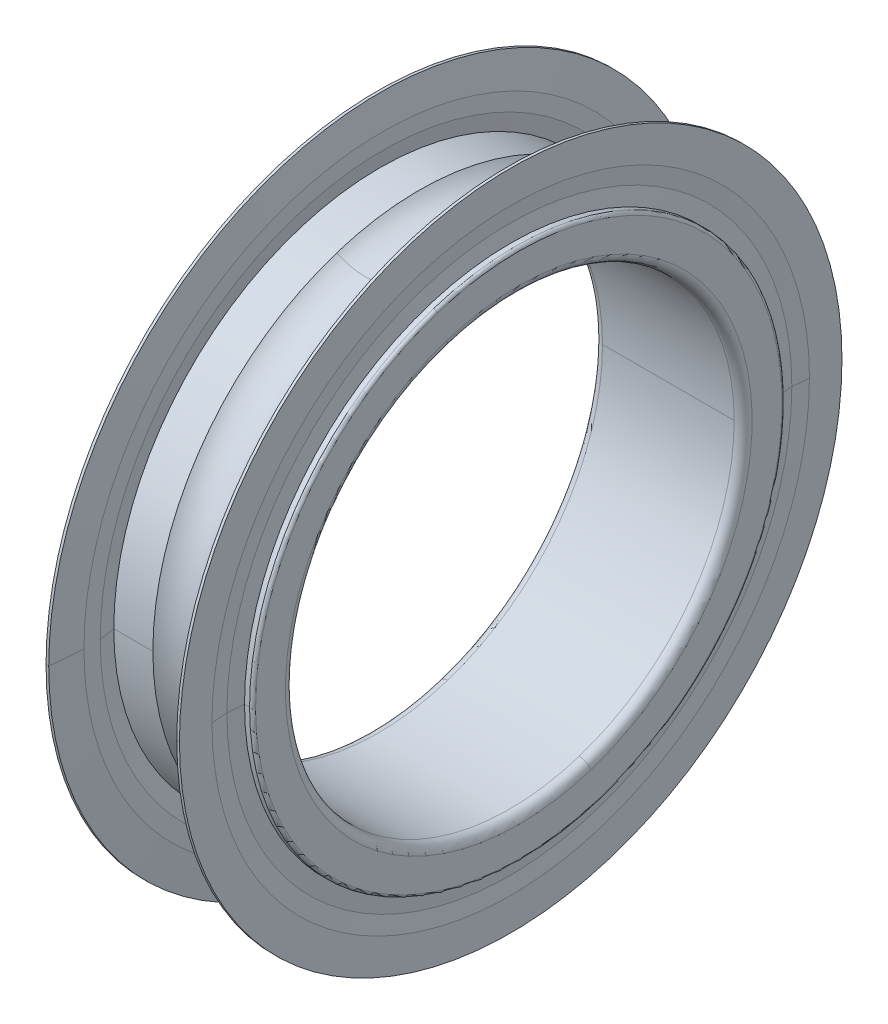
ISO-10303-21;
HEADER;
FILE_DESCRIPTION(('STEP AP214'),'2;1');
FILE_NAME('part.step','',(''),(''),'','','');
FILE_SCHEMA(('AUTOMOTIVE_DESIGN { 1 0 10303 214 1 1 1 1 }'));
ENDSEC;
DATA;
#1=APPLICATION_CONTEXT('core data for automotive mechanical design processes');
#2=APPLICATION_PROTOCOL_DEFINITION('international standard','automotive_design',2000,#1);
#3=PRODUCT_CONTEXT('',#1,'mechanical');
#4=PRODUCT('Part','Part','',(#3));
#5=PRODUCT_RELATED_PRODUCT_CATEGORY('part','',(#4));
#6=PRODUCT_DEFINITION_FORMATION('','',#4);
#7=PRODUCT_DEFINITION_CONTEXT('part definition',#1,'design');
#8=PRODUCT_DEFINITION('design','',#6,#7);
#9=PRODUCT_DEFINITION_SHAPE('','',#8);
#10=(LENGTH_UNIT() NAMED_UNIT(*) SI_UNIT(.MILLI.,.METRE.));
#11=(NAMED_UNIT(*) PLANE_ANGLE_UNIT() SI_UNIT($,.RADIAN.));
#12=(NAMED_UNIT(*) SI_UNIT($,.STERADIAN.) SOLID_ANGLE_UNIT());
#13=UNCERTAINTY_MEASURE_WITH_UNIT(LENGTH_MEASURE(1.E-05),#10,'distance_accuracy_value','');
#14=(GEOMETRIC_REPRESENTATION_CONTEXT(3) GLOBAL_UNCERTAINTY_ASSIGNED_CONTEXT((#13)) GLOBAL_UNIT_ASSIGNED_CONTEXT((#10,
#11,#12)) REPRESENTATION_CONTEXT('',''));
#15=CARTESIAN_POINT('',(0.,0.,0.));
#16=DIRECTION('',(0.,0.,1.));
#17=DIRECTION('',(1.,0.,0.));
#18=AXIS2_PLACEMENT_3D('',#15,#16,#17);
#19=CARTESIAN_POINT('',(50.,0.,0.));
#20=DIRECTION('',(1.,0.,0.));
#21=DIRECTION('',(0.,1.,-1.28642154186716E-11));
#22=AXIS2_PLACEMENT_3D('',#19,#20,#21);
#23=CYLINDRICAL_SURFACE('',#22,8.9);
#24=DIRECTION('',(1.,0.,0.));
#25=VECTOR('',#24,1.);
#26=CARTESIAN_POINT('',(3.3335407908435,0.,8.9));
#27=LINE('',#26,#25);
#28=CARTESIAN_POINT('',(3.3335407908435,0.,8.9));
#29=VERTEX_POINT('',#28);
#30=CARTESIAN_POINT('',(4.64,0.,8.9));
#31=VERTEX_POINT('',#30);
#32=EDGE_CURVE('E10',#29,#31,#27,.T.);
#33=ORIENTED_EDGE('',*,*,#32,.F.);
#34=CARTESIAN_POINT('',(3.3335407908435,0.,0.));
#35=DIRECTION('',(1.,0.,0.));
#36=DIRECTION('',(0.,0.,-1.));
#37=AXIS2_PLACEMENT_3D('',#34,#35,#36);
#38=CIRCLE('',#37,8.9);
#39=CARTESIAN_POINT('',(3.3335407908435,-8.46440299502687,-2.75025124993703));
#40=VERTEX_POINT('',#39);
#41=EDGE_CURVE('E24',#29,#40,#38,.T.);
#42=ORIENTED_EDGE('',*,*,#41,.T.);
#43=CARTESIAN_POINT('',(3.3335407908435,0.,0.));
#44=DIRECTION('',(1.,0.,0.));
#45=DIRECTION('',(0.,0.,-1.));
#46=AXIS2_PLACEMENT_3D('',#43,#44,#45);
#47=CIRCLE('',#46,8.9);
#48=CARTESIAN_POINT('',(3.3335407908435,0.,-8.9));
#49=VERTEX_POINT('',#48);
#50=EDGE_CURVE('E688',#40,#49,#47,.T.);
#51=ORIENTED_EDGE('',*,*,#50,.T.);
#52=DIRECTION('',(1.,0.,0.));
#53=VECTOR('',#52,1.);
#54=CARTESIAN_POINT('',(3.3335407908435,0.,-8.9));
#55=LINE('',#54,#53);
#56=CARTESIAN_POINT('',(4.64,0.,-8.9));
#57=VERTEX_POINT('',#56);
#58=EDGE_CURVE('E684',#49,#57,#55,.T.);
#59=ORIENTED_EDGE('',*,*,#58,.T.);
#60=CARTESIAN_POINT('',(4.64,0.,0.));
#61=DIRECTION('',(1.,0.,0.));
#62=DIRECTION('',(0.,0.,-1.));
#63=AXIS2_PLACEMENT_3D('',#60,#61,#62);
#64=CIRCLE('',#63,8.9);
#65=EDGE_CURVE('E679',#31,#57,#64,.T.);
#66=ORIENTED_EDGE('',*,*,#65,.F.);
#67=EDGE_LOOP('',(#33,#42,#51,#59,#66));
#68=FACE_BOUND('',#67,.T.);
#69=ADVANCED_FACE('F16',(#68),#23,.T.);
#70=CARTESIAN_POINT('',(4.55,0.,0.));
#71=DIRECTION('',(-1.,0.,0.));
#72=DIRECTION('',(0.,1.,0.));
#73=AXIS2_PLACEMENT_3D('',#70,#71,#72);
#74=CONICAL_SURFACE('',#73,9.44375,1.40676621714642);
#75=DIRECTION('',(-0.163295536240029,0.,-0.986577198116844));
#76=VECTOR('',#75,1.);
#77=CARTESIAN_POINT('',(4.64,0.,-8.9));
#78=LINE('',#77,#76);
#79=CARTESIAN_POINT('',(4.55,0.,-9.44375));
#80=VERTEX_POINT('',#79);
#81=EDGE_CURVE('E677',#57,#80,#78,.T.);
#82=ORIENTED_EDGE('',*,*,#81,.T.);
#83=CARTESIAN_POINT('',(4.55,0.,9.44375));
#84=CARTESIAN_POINT('',(4.55,-2.96591378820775,9.44254499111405));
#85=CARTESIAN_POINT('',(4.55,-5.93749601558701,8.28382540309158));
#86=CARTESIAN_POINT('',(4.55,-8.28153976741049,5.93494507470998));
#87=CARTESIAN_POINT('',(4.55,-10.6059602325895,0.));
#88=CARTESIAN_POINT('',(4.55,-8.2815397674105,-5.93494507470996));
#89=CARTESIAN_POINT('',(4.55,-5.93749601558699,-8.28382540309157));
#90=CARTESIAN_POINT('',(4.55,-2.96591378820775,-9.44254499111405));
#91=CARTESIAN_POINT('',(4.55,0.,-9.44375));
#92=B_SPLINE_CURVE_WITH_KNOTS('',5,(#83,#84,#85,#86,#87,#88,#89,#90,#91),.UNSPECIFIED.,.F.,.F.,
(6,3,6),(3.14159265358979,4.71238898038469,6.28318530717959),.UNSPECIFIED.);
#93=CARTESIAN_POINT('',(4.55,0.,9.44375));
#94=VERTEX_POINT('',#93);
#95=EDGE_CURVE('E675',#94,#80,#92,.T.);
#96=ORIENTED_EDGE('',*,*,#95,.F.);
#97=DIRECTION('',(-0.163295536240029,0.,0.986577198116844));
#98=VECTOR('',#97,1.);
#99=CARTESIAN_POINT('',(4.64,0.,8.9));
#100=LINE('',#99,#98);
#101=EDGE_CURVE('E706',#31,#94,#100,.T.);
#102=ORIENTED_EDGE('',*,*,#101,.F.);
#103=ORIENTED_EDGE('',*,*,#65,.T.);
#104=EDGE_LOOP('',(#82,#96,#102,#103));
#105=FACE_BOUND('',#104,.T.);
#106=ADVANCED_FACE('F646',(#105),#74,.F.);
#107=CARTESIAN_POINT('',(4.55,0.,0.));
#108=DIRECTION('',(-1.,0.,0.));
#109=DIRECTION('',(0.,-1.,0.));
#110=AXIS2_PLACEMENT_3D('',#107,#108,#109);
#111=CONICAL_SURFACE('',#110,9.44375,1.40676621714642);
#112=ORIENTED_EDGE('',*,*,#81,.F.);
#113=CARTESIAN_POINT('',(4.64,0.,0.));
#114=DIRECTION('',(1.,0.,0.));
#115=DIRECTION('',(0.,0.,-1.));
#116=AXIS2_PLACEMENT_3D('',#113,#114,#115);
#117=CIRCLE('',#116,8.9);
#118=EDGE_CURVE('E704',#57,#31,#117,.T.);
#119=ORIENTED_EDGE('',*,*,#118,.T.);
#120=ORIENTED_EDGE('',*,*,#101,.T.);
#121=CARTESIAN_POINT('',(4.55,0.,0.));
#122=DIRECTION('',(1.,0.,0.));
#123=DIRECTION('',(0.,0.,-1.));
#124=AXIS2_PLACEMENT_3D('',#121,#122,#123);
#125=CIRCLE('',#124,9.44375);
#126=EDGE_CURVE('E707',#80,#94,#125,.T.);
#127=ORIENTED_EDGE('',*,*,#126,.F.);
#128=EDGE_LOOP('',(#112,#119,#120,#127));
#129=FACE_BOUND('',#128,.T.);
#130=ADVANCED_FACE('F650',(#129),#111,.F.);
#131=CARTESIAN_POINT('',(4.55,9.9875,0.));
#132=DIRECTION('',(-1.,0.,0.));
#133=DIRECTION('',(0.,0.,1.));
#134=AXIS2_PLACEMENT_3D('',#131,#132,#133);
#135=PLANE('',#134);
#136=ORIENTED_EDGE('',*,*,#126,.T.);
#137=ORIENTED_EDGE('',*,*,#95,.T.);
#138=EDGE_LOOP('',(#136,#137));
#139=FACE_BOUND('',#138,.T.);
#140=CARTESIAN_POINT('',(4.55,0.,0.));
#141=DIRECTION('',(1.,0.,0.));
#142=DIRECTION('',(0.,0.,1.));
#143=AXIS2_PLACEMENT_3D('',#140,#141,#142);
#144=CIRCLE('',#143,9.9875);
#145=CARTESIAN_POINT('',(4.55,0.,9.98749999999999));
#146=VERTEX_POINT('',#145);
#147=CARTESIAN_POINT('',(4.55,0.,-9.9875));
#148=VERTEX_POINT('',#147);
#149=EDGE_CURVE('E716',#146,#148,#144,.T.);
#150=ORIENTED_EDGE('',*,*,#149,.F.);
#151=CARTESIAN_POINT('',(4.55,0.,0.));
#152=DIRECTION('',(1.,0.,0.));
#153=DIRECTION('',(0.,0.,-1.));
#154=AXIS2_PLACEMENT_3D('',#151,#152,#153);
#155=CIRCLE('',#154,9.9875);
#156=EDGE_CURVE('E750',#148,#146,#155,.T.);
#157=ORIENTED_EDGE('',*,*,#156,.F.);
#158=EDGE_LOOP('',(#150,#157));
#159=FACE_BOUND('',#158,.T.);
#160=ADVANCED_FACE('F655',(#139,#159),#135,.T.);
#161=CARTESIAN_POINT('',(4.64,0.,0.));
#162=DIRECTION('',(1.,0.,0.));
#163=DIRECTION('',(0.,-1.,0.));
#164=AXIS2_PLACEMENT_3D('',#161,#162,#163);
#165=CONICAL_SURFACE('',#164,11.075,1.48822587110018);
#166=DIRECTION('',(0.0824766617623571,0.,0.996592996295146));
#167=VECTOR('',#166,1.);
#168=CARTESIAN_POINT('',(4.55,0.,9.98749999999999));
#169=LINE('',#168,#167);
#170=CARTESIAN_POINT('',(4.64,0.,11.075));
#171=VERTEX_POINT('',#170);
#172=EDGE_CURVE('E763',#146,#171,#169,.T.);
#173=ORIENTED_EDGE('',*,*,#172,.T.);
#174=CARTESIAN_POINT('',(4.64,0.,0.));
#175=DIRECTION('',(1.,0.,0.));
#176=DIRECTION('',(0.,0.,-1.));
#177=AXIS2_PLACEMENT_3D('',#174,#175,#176);
#178=CIRCLE('',#177,11.075);
#179=CARTESIAN_POINT('',(4.64,0.,-11.075));
#180=VERTEX_POINT('',#179);
#181=EDGE_CURVE('E767',#180,#171,#178,.T.);
#182=ORIENTED_EDGE('',*,*,#181,.F.);
#183=DIRECTION('',(0.0824766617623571,0.,-0.996592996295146));
#184=VECTOR('',#183,1.);
#185=CARTESIAN_POINT('',(4.55,0.,-9.98749999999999));
#186=LINE('',#185,#184);
#187=EDGE_CURVE('E765',#148,#180,#186,.T.);
#188=ORIENTED_EDGE('',*,*,#187,.F.);
#189=ORIENTED_EDGE('',*,*,#156,.T.);
#190=EDGE_LOOP('',(#173,#182,#188,#189));
#191=FACE_BOUND('',#190,.T.);
#192=ADVANCED_FACE('F731',(#191),#165,.T.);
#193=CARTESIAN_POINT('',(4.64,0.,0.));
#194=DIRECTION('',(1.,0.,0.));
#195=DIRECTION('',(0.,1.,0.));
#196=AXIS2_PLACEMENT_3D('',#193,#194,#195);
#197=CONICAL_SURFACE('',#196,11.075,1.48822587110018);
#198=ORIENTED_EDGE('',*,*,#172,.F.);
#199=ORIENTED_EDGE('',*,*,#149,.T.);
#200=ORIENTED_EDGE('',*,*,#187,.T.);
#201=CARTESIAN_POINT('',(4.64,0.,0.));
#202=DIRECTION('',(1.,0.,0.));
#203=DIRECTION('',(0.,0.,-1.));
#204=AXIS2_PLACEMENT_3D('',#201,#202,#203);
#205=CIRCLE('',#204,11.075);
#206=EDGE_CURVE('E772',#171,#180,#205,.T.);
#207=ORIENTED_EDGE('',*,*,#206,.F.);
#208=EDGE_LOOP('',(#198,#199,#200,#207));
#209=FACE_BOUND('',#208,.T.);
#210=ADVANCED_FACE('F775',(#209),#197,.T.);
#211=CARTESIAN_POINT('',(2.,0.,0.));
#212=DIRECTION('',(1.,0.,0.));
#213=DIRECTION('',(0.,1.,0.));
#214=AXIS2_PLACEMENT_3D('',#211,#212,#213);
#215=CYLINDRICAL_SURFACE('',#214,11.075);
#216=DIRECTION('',(1.,0.,0.));
#217=VECTOR('',#216,1.);
#218=CARTESIAN_POINT('',(4.64,0.,11.075));
#219=LINE('',#218,#217);
#220=CARTESIAN_POINT('',(4.73,0.,11.075));
#221=VERTEX_POINT('',#220);
#222=EDGE_CURVE('E795',#171,#221,#219,.T.);
#223=ORIENTED_EDGE('',*,*,#222,.F.);
#224=ORIENTED_EDGE('',*,*,#206,.T.);
#225=DIRECTION('',(1.,0.,0.));
#226=VECTOR('',#225,1.);
#227=CARTESIAN_POINT('',(4.64,0.,-11.075));
#228=LINE('',#227,#226);
#229=CARTESIAN_POINT('',(4.73,0.,-11.075));
#230=VERTEX_POINT('',#229);
#231=EDGE_CURVE('E804',#180,#230,#228,.T.);
#232=ORIENTED_EDGE('',*,*,#231,.T.);
#233=CARTESIAN_POINT('',(4.73,0.,0.));
#234=DIRECTION('',(1.,0.,0.));
#235=DIRECTION('',(0.,0.,-1.));
#236=AXIS2_PLACEMENT_3D('',#233,#234,#235);
#237=CIRCLE('',#236,11.075);
#238=EDGE_CURVE('E800',#221,#230,#237,.T.);
#239=ORIENTED_EDGE('',*,*,#238,.F.);
#240=EDGE_LOOP('',(#223,#224,#232,#239));
#241=FACE_BOUND('',#240,.T.);
#242=ADVANCED_FACE('F798',(#241),#215,.T.);
#243=CARTESIAN_POINT('',(4.73,9.9875,0.));
#244=DIRECTION('',(1.,0.,0.));
#245=DIRECTION('',(0.,0.,-1.));
#246=AXIS2_PLACEMENT_3D('',#243,#244,#245);
#247=PLANE('',#246);
#248=CARTESIAN_POINT('',(4.73,0.,0.));
#249=DIRECTION('',(1.,0.,0.));
#250=DIRECTION('',(0.,0.,-1.));
#251=AXIS2_PLACEMENT_3D('',#248,#249,#250);
#252=CIRCLE('',#251,11.075);
#253=EDGE_CURVE('E807',#230,#221,#252,.T.);
#254=ORIENTED_EDGE('',*,*,#253,.T.);
#255=ORIENTED_EDGE('',*,*,#238,.T.);
#256=EDGE_LOOP('',(#254,#255));
#257=FACE_BOUND('',#256,.T.);
#258=CARTESIAN_POINT('',(4.73,0.,0.));
#259=DIRECTION('',(1.,0.,0.));
#260=DIRECTION('',(0.,0.,1.));
#261=AXIS2_PLACEMENT_3D('',#258,#259,#260);
#262=CIRCLE('',#261,9.9875);
#263=CARTESIAN_POINT('',(4.73,0.,9.9875));
#264=VERTEX_POINT('',#263);
#265=CARTESIAN_POINT('',(4.73,0.,-9.9875));
#266=VERTEX_POINT('',#265);
#267=EDGE_CURVE('E821',#264,#266,#262,.T.);
#268=ORIENTED_EDGE('',*,*,#267,.F.);
#269=CARTESIAN_POINT('',(4.73,0.,0.));
#270=DIRECTION('',(1.,0.,0.));
#271=DIRECTION('',(0.,0.,-1.));
#272=AXIS2_PLACEMENT_3D('',#269,#270,#271);
#273=CIRCLE('',#272,9.9875);
#274=EDGE_CURVE('E858',#266,#264,#273,.T.);
#275=ORIENTED_EDGE('',*,*,#274,.F.);
#276=EDGE_LOOP('',(#268,#275));
#277=FACE_BOUND('',#276,.T.);
#278=ADVANCED_FACE('F831',(#257,#277),#247,.T.);
#279=CARTESIAN_POINT('',(4.685,0.,0.));
#280=DIRECTION('',(1.,0.,0.));
#281=DIRECTION('',(0.,-1.,0.));
#282=AXIS2_PLACEMENT_3D('',#279,#280,#281);
#283=CONICAL_SURFACE('',#282,9.44375,1.48822587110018);
#284=DIRECTION('',(0.0824766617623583,0.,0.996592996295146));
#285=VECTOR('',#284,1.);
#286=CARTESIAN_POINT('',(4.685,0.,9.44375));
#287=LINE('',#286,#285);
#288=CARTESIAN_POINT('',(4.685,0.,9.44374999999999));
#289=VERTEX_POINT('',#288);
#290=EDGE_CURVE('E856',#289,#264,#287,.T.);
#291=ORIENTED_EDGE('',*,*,#290,.F.);
#292=CARTESIAN_POINT('',(4.685,0.,0.));
#293=DIRECTION('',(1.,0.,0.));
#294=DIRECTION('',(0.,0.,-1.));
#295=AXIS2_PLACEMENT_3D('',#292,#293,#294);
#296=CIRCLE('',#295,9.44375);
#297=CARTESIAN_POINT('',(4.685,0.,-9.44375));
#298=VERTEX_POINT('',#297);
#299=EDGE_CURVE('E859',#298,#289,#296,.T.);
#300=ORIENTED_EDGE('',*,*,#299,.F.);
#301=DIRECTION('',(0.0824766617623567,0.,-0.996592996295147));
#302=VECTOR('',#301,1.);
#303=CARTESIAN_POINT('',(4.685,0.,-9.44375));
#304=LINE('',#303,#302);
#305=EDGE_CURVE('E864',#298,#266,#304,.T.);
#306=ORIENTED_EDGE('',*,*,#305,.T.);
#307=ORIENTED_EDGE('',*,*,#274,.T.);
#308=EDGE_LOOP('',(#291,#300,#306,#307));
#309=FACE_BOUND('',#308,.T.);
#310=ADVANCED_FACE('F841',(#309),#283,.F.);
#311=CARTESIAN_POINT('',(4.685,0.,0.));
#312=DIRECTION('',(1.,0.,0.));
#313=DIRECTION('',(0.,1.,0.));
#314=AXIS2_PLACEMENT_3D('',#311,#312,#313);
#315=CONICAL_SURFACE('',#314,9.44375,1.48822587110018);
#316=ORIENTED_EDGE('',*,*,#290,.T.);
#317=ORIENTED_EDGE('',*,*,#267,.T.);
#318=ORIENTED_EDGE('',*,*,#305,.F.);
#319=CARTESIAN_POINT('',(4.685,0.,0.));
#320=DIRECTION('',(1.,0.,0.));
#321=DIRECTION('',(0.,0.,-1.));
#322=AXIS2_PLACEMENT_3D('',#319,#320,#321);
#323=CIRCLE('',#322,9.44375);
#324=EDGE_CURVE('E869',#289,#298,#323,.T.);
#325=ORIENTED_EDGE('',*,*,#324,.F.);
#326=EDGE_LOOP('',(#316,#317,#318,#325));
#327=FACE_BOUND('',#326,.T.);
#328=ADVANCED_FACE('F889',(#327),#315,.F.);
#329=CARTESIAN_POINT('',(4.73,0.,0.));
#330=DIRECTION('',(-1.,0.,0.));
#331=DIRECTION('',(0.,1.,0.));
#332=AXIS2_PLACEMENT_3D('',#329,#330,#331);
#333=CONICAL_SURFACE('',#332,8.9,1.48822587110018);
#334=DIRECTION('',(-0.0824766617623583,0.,-0.996592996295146));
#335=VECTOR('',#334,1.);
#336=CARTESIAN_POINT('',(4.73,0.,-8.89999999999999));
#337=LINE('',#336,#335);
#338=CARTESIAN_POINT('',(4.73,0.,-8.9));
#339=VERTEX_POINT('',#338);
#340=EDGE_CURVE('E999',#339,#298,#337,.T.);
#341=ORIENTED_EDGE('',*,*,#340,.F.);
#342=CARTESIAN_POINT('',(4.73,0.,0.));
#343=DIRECTION('',(1.,0.,0.));
#344=DIRECTION('',(0.,0.,-1.));
#345=AXIS2_PLACEMENT_3D('',#342,#343,#344);
#346=CIRCLE('',#345,8.9);
#347=CARTESIAN_POINT('',(4.73,0.,8.89999999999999));
#348=VERTEX_POINT('',#347);
#349=EDGE_CURVE('E994',#348,#339,#346,.T.);
#350=ORIENTED_EDGE('',*,*,#349,.F.);
#351=DIRECTION('',(-0.0824766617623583,0.,0.996592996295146));
#352=VECTOR('',#351,1.);
#353=CARTESIAN_POINT('',(4.73,0.,8.89999999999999));
#354=LINE('',#353,#352);
#355=EDGE_CURVE('E989',#348,#289,#354,.T.);
#356=ORIENTED_EDGE('',*,*,#355,.T.);
#357=ORIENTED_EDGE('',*,*,#324,.T.);
#358=EDGE_LOOP('',(#341,#350,#356,#357));
#359=FACE_BOUND('',#358,.T.);
#360=ADVANCED_FACE('F898',(#359),#333,.T.);
#361=CARTESIAN_POINT('',(4.73,0.,0.));
#362=DIRECTION('',(-1.,0.,0.));
#363=DIRECTION('',(0.,-1.,0.));
#364=AXIS2_PLACEMENT_3D('',#361,#362,#363);
#365=CONICAL_SURFACE('',#364,8.9,1.48822587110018);
#366=ORIENTED_EDGE('',*,*,#340,.T.);
#367=ORIENTED_EDGE('',*,*,#299,.T.);
#368=ORIENTED_EDGE('',*,*,#355,.F.);
#369=CARTESIAN_POINT('',(4.73,0.,0.));
#370=DIRECTION('',(1.,0.,0.));
#371=DIRECTION('',(0.,0.,-1.));
#372=AXIS2_PLACEMENT_3D('',#369,#370,#371);
#373=CIRCLE('',#372,8.9);
#374=EDGE_CURVE('E984',#339,#348,#373,.T.);
#375=ORIENTED_EDGE('',*,*,#374,.F.);
#376=EDGE_LOOP('',(#366,#367,#368,#375));
#377=FACE_BOUND('',#376,.T.);
#378=ADVANCED_FACE('F901',(#377),#365,.T.);
#379=CARTESIAN_POINT('',(50.,0.,0.));
#380=DIRECTION('',(1.,0.,0.));
#381=DIRECTION('',(0.,-1.,-1.28642154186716E-11));
#382=AXIS2_PLACEMENT_3D('',#379,#380,#381);
#383=CYLINDRICAL_SURFACE('',#382,8.9);
#384=DIRECTION('',(1.,0.,0.));
#385=VECTOR('',#384,1.);
#386=CARTESIAN_POINT('',(4.73,0.,8.9));
#387=LINE('',#386,#385);
#388=CARTESIAN_POINT('',(4.9,0.,8.9));
#389=VERTEX_POINT('',#388);
#390=EDGE_CURVE('E980',#348,#389,#387,.T.);
#391=ORIENTED_EDGE('',*,*,#390,.T.);
#392=CARTESIAN_POINT('',(4.9,0.,0.));
#393=DIRECTION('',(1.,0.,0.));
#394=DIRECTION('',(0.,0.,-1.));
#395=AXIS2_PLACEMENT_3D('',#392,#393,#394);
#396=CIRCLE('',#395,8.9);
#397=CARTESIAN_POINT('',(4.9,8.46440299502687,2.75025124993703));
#398=VERTEX_POINT('',#397);
#399=EDGE_CURVE('E975',#398,#389,#396,.T.);
#400=ORIENTED_EDGE('',*,*,#399,.F.);
#401=CARTESIAN_POINT('',(4.9,0.,0.));
#402=DIRECTION('',(1.,0.,0.));
#403=DIRECTION('',(0.,0.,-1.));
#404=AXIS2_PLACEMENT_3D('',#401,#402,#403);
#405=CIRCLE('',#404,8.9);
#406=CARTESIAN_POINT('',(4.9,0.,-8.9));
#407=VERTEX_POINT('',#406);
#408=EDGE_CURVE('E970',#407,#398,#405,.T.);
#409=ORIENTED_EDGE('',*,*,#408,.F.);
#410=DIRECTION('',(1.,0.,0.));
#411=VECTOR('',#410,1.);
#412=CARTESIAN_POINT('',(4.73,0.,-8.9));
#413=LINE('',#412,#411);
#414=EDGE_CURVE('E965',#339,#407,#413,.T.);
#415=ORIENTED_EDGE('',*,*,#414,.F.);
#416=ORIENTED_EDGE('',*,*,#374,.T.);
#417=EDGE_LOOP('',(#391,#400,#409,#415,#416));
#418=FACE_BOUND('',#417,.T.);
#419=ADVANCED_FACE('F905',(#418),#383,.T.);
#420=CARTESIAN_POINT('',(50.,0.,0.));
#421=DIRECTION('',(1.,0.,0.));
#422=DIRECTION('',(0.,1.,0.));
#423=AXIS2_PLACEMENT_3D('',#420,#421,#422);
#424=CYLINDRICAL_SURFACE('',#423,8.9);
#425=ORIENTED_EDGE('',*,*,#390,.F.);
#426=ORIENTED_EDGE('',*,*,#349,.T.);
#427=ORIENTED_EDGE('',*,*,#414,.T.);
#428=CARTESIAN_POINT('',(4.9,0.,0.));
#429=DIRECTION('',(1.,0.,0.));
#430=DIRECTION('',(0.,0.,-1.));
#431=AXIS2_PLACEMENT_3D('',#428,#429,#430);
#432=CIRCLE('',#431,8.9);
#433=CARTESIAN_POINT('',(4.9,-8.46440299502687,-2.75025124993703));
#434=VERTEX_POINT('',#433);
#435=EDGE_CURVE('E960',#434,#407,#432,.T.);
#436=ORIENTED_EDGE('',*,*,#435,.F.);
#437=CARTESIAN_POINT('',(4.9,0.,0.));
#438=DIRECTION('',(1.,0.,0.));
#439=DIRECTION('',(0.,0.,-1.));
#440=AXIS2_PLACEMENT_3D('',#437,#438,#439);
#441=CIRCLE('',#440,8.9);
#442=EDGE_CURVE('E955',#389,#434,#441,.T.);
#443=ORIENTED_EDGE('',*,*,#442,.F.);
#444=EDGE_LOOP('',(#425,#426,#427,#436,#443));
#445=FACE_BOUND('',#444,.T.);
#446=ADVANCED_FACE('F909',(#445),#424,.T.);
#447=CARTESIAN_POINT('',(4.90000000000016,0.,0.));
#448=DIRECTION('',(1.,0.,0.));
#449=DIRECTION('',(0.,0.309016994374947,-0.951056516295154));
#450=AXIS2_PLACEMENT_3D('',#447,#448,#449);
#451=TOROIDAL_SURFACE('',#450,8.80000000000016,0.0999999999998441);
#452=CARTESIAN_POINT('',(4.90000000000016,-8.36929734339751,-2.71934955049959));
#453=DIRECTION('',(0.,0.309016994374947,-0.951056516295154));
#454=DIRECTION('',(1.,0.,0.));
#455=AXIS2_PLACEMENT_3D('',#452,#453,#454);
#456=CIRCLE('',#455,0.0999999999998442);
#457=CARTESIAN_POINT('',(5.,-8.36929734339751,-2.71934955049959));
#458=VERTEX_POINT('',#457);
#459=EDGE_CURVE('E951',#458,#434,#456,.T.);
#460=ORIENTED_EDGE('',*,*,#459,.F.);
#461=CARTESIAN_POINT('',(5.,0.,0.));
#462=DIRECTION('',(1.,0.,0.));
#463=DIRECTION('',(0.,0.,-1.));
#464=AXIS2_PLACEMENT_3D('',#461,#462,#463);
#465=CIRCLE('',#464,8.8);
#466=CARTESIAN_POINT('',(5.,8.36929734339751,2.71934955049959));
#467=VERTEX_POINT('',#466);
#468=EDGE_CURVE('E946',#467,#458,#465,.T.);
#469=ORIENTED_EDGE('',*,*,#468,.F.);
#470=CARTESIAN_POINT('',(4.90000000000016,8.36929734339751,2.71934955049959));
#471=DIRECTION('',(0.,-0.309016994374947,0.951056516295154));
#472=DIRECTION('',(1.,0.,0.));
#473=AXIS2_PLACEMENT_3D('',#470,#471,#472);
#474=CIRCLE('',#473,0.0999999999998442);
#475=EDGE_CURVE('E943',#467,#398,#474,.T.);
#476=ORIENTED_EDGE('',*,*,#475,.T.);
#477=ORIENTED_EDGE('',*,*,#399,.T.);
#478=ORIENTED_EDGE('',*,*,#442,.T.);
#479=EDGE_LOOP('',(#460,#469,#476,#477,#478));
#480=FACE_BOUND('',#479,.T.);
#481=ADVANCED_FACE('F913',(#480),#451,.T.);
#482=CARTESIAN_POINT('',(4.90000000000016,0.,0.));
#483=DIRECTION('',(1.,0.,0.));
#484=DIRECTION('',(0.,-0.309016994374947,0.951056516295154));
#485=AXIS2_PLACEMENT_3D('',#482,#483,#484);
#486=TOROIDAL_SURFACE('',#485,8.80000000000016,0.0999999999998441);
#487=ORIENTED_EDGE('',*,*,#459,.T.);
#488=ORIENTED_EDGE('',*,*,#435,.T.);
#489=ORIENTED_EDGE('',*,*,#408,.T.);
#490=ORIENTED_EDGE('',*,*,#475,.F.);
#491=CARTESIAN_POINT('',(5.,-8.36929734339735,-2.71934955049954));
#492=CARTESIAN_POINT('',(5.,-7.51418773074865,-5.34747265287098));
#493=CARTESIAN_POINT('',(5.,-5.63162629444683,-7.64731028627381));
#494=CARTESIAN_POINT('',(5.,-2.87501454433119,-9.04829744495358));
#495=CARTESIAN_POINT('',(5.,3.05401066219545,-9.3992783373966));
#496=CARTESIAN_POINT('',(5.,7.64439142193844,-5.63033525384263));
#497=CARTESIAN_POINT('',(5.,9.05105758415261,-2.87661710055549));
#498=CARTESIAN_POINT('',(5.,9.22227113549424,0.0905324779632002));
#499=CARTESIAN_POINT('',(5.,8.36929734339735,2.71934955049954));
#500=B_SPLINE_CURVE_WITH_KNOTS('',5,(#491,#492,#493,#494,#495,#496,#497,#498,#499),
.UNSPECIFIED.,.F.,.F.,(6,3,6),(0.,1.5707963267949,3.14159265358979),.UNSPECIFIED.);
#501=EDGE_CURVE('E942',#458,#467,#500,.T.);
#502=ORIENTED_EDGE('',*,*,#501,.F.);
#503=EDGE_LOOP('',(#487,#488,#489,#490,#502));
#504=FACE_BOUND('',#503,.T.);
#505=ADVANCED_FACE('F917',(#504),#486,.T.);
#506=CARTESIAN_POINT('',(5.,7.8,0.));
#507=DIRECTION('',(1.,0.,0.));
#508=DIRECTION('',(0.,0.,-1.));
#509=AXIS2_PLACEMENT_3D('',#506,#507,#508);
#510=PLANE('',#509);
#511=ORIENTED_EDGE('',*,*,#468,.T.);
#512=ORIENTED_EDGE('',*,*,#501,.T.);
#513=EDGE_LOOP('',(#511,#512));
#514=FACE_BOUND('',#513,.T.);
#515=CARTESIAN_POINT('',(5.,-7.41824082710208,-2.41033255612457));
#516=CARTESIAN_POINT('',(5.,-7.3788043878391,-2.53171419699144));
#517=CARTESIAN_POINT('',(5.,-7.33638383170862,-2.65212599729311));
#518=CARTESIAN_POINT('',(5.,-7.2456878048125,-2.89072406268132));
#519=CARTESIAN_POINT('',(5.,-7.19741233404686,-3.00891032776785));
#520=CARTESIAN_POINT('',(5.,-7.09511979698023,-3.24277146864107));
#521=CARTESIAN_POINT('',(5.,-7.04110273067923,-3.35844634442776));
#522=CARTESIAN_POINT('',(5.,-6.92745793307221,-3.58700633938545));
#523=CARTESIAN_POINT('',(5.,-6.86783020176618,-3.69989145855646));
#524=CARTESIAN_POINT('',(5.,-6.74310750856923,-3.92259990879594));
#525=CARTESIAN_POINT('',(5.,-6.67801254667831,-4.03242323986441));
#526=CARTESIAN_POINT('',(5.,-6.54251226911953,-4.24874356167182));
#527=CARTESIAN_POINT('',(5.,-6.47210695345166,-4.35524055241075));
#528=CARTESIAN_POINT('',(5.,-6.32615556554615,-4.56465162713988));
#529=CARTESIAN_POINT('',(5.,-6.25060949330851,-4.66756571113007));
#530=CARTESIAN_POINT('',(5.,-6.09455859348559,-4.86956304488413));
#531=CARTESIAN_POINT('',(5.,-6.01405376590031,-4.968646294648));
#532=CARTESIAN_POINT('',(5.,-5.84827929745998,-5.16274325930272));
#533=CARTESIAN_POINT('',(5.,-5.76300965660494,-5.25775697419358));
#534=CARTESIAN_POINT('',(5.,-5.58791098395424,-5.44348597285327));
#535=CARTESIAN_POINT('',(5.,-5.49808195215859,-5.53420125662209));
#536=CARTESIAN_POINT('',(5.,-5.31408090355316,-5.71111485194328));
#537=CARTESIAN_POINT('',(5.,-5.21990888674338,-5.79731316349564));
#538=CARTESIAN_POINT('',(5.,-5.0274487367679,-5.96498515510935));
#539=CARTESIAN_POINT('',(5.,-4.92916060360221,-6.04645883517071));
#540=CARTESIAN_POINT('',(5.,-4.72870500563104,-6.20448528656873));
#541=CARTESIAN_POINT('',(5.,-4.62653754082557,-6.2810380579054));
#542=CARTESIAN_POINT('',(5.,-4.4185694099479,-6.42903826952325));
#543=CARTESIAN_POINT('',(5.,-4.3127687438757,-6.50048570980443));
#544=CARTESIAN_POINT('',(5.,-4.09778909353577,-6.63810313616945));
#545=CARTESIAN_POINT('',(5.,-3.98861010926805,-6.70427312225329));
#546=CARTESIAN_POINT('',(5.,-3.76713684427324,-6.83117623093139));
#547=CARTESIAN_POINT('',(5.,-3.65484256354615,-6.89190935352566));
#548=CARTESIAN_POINT('',(5.,-3.42740923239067,-7.00779242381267));
#549=CARTESIAN_POINT('',(5.,-3.31227018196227,-7.06294237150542));
#550=CARTESIAN_POINT('',(5.,-3.07942469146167,-7.16752623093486));
#551=CARTESIAN_POINT('',(5.,-2.96171825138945,-7.21696014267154));
#552=CARTESIAN_POINT('',(5.,-2.72402154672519,-7.30999283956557));
#553=CARTESIAN_POINT('',(5.,-2.60403128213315,-7.35359162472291));
#554=CARTESIAN_POINT('',(5.,-2.36205599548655,-7.43484903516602));
#555=CARTESIAN_POINT('',(5.,-2.24007097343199,-7.47250766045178));
#556=CARTESIAN_POINT('',(5.,-1.99440004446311,-7.54179402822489));
#557=CARTESIAN_POINT('',(5.,-1.87071413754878,-7.57342177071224));
#558=CARTESIAN_POINT('',(5.,-1.62193940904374,-7.63057017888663));
#559=CARTESIAN_POINT('',(5.,-1.49685058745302,-7.65609084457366));
#560=CARTESIAN_POINT('',(5.,-1.24557137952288,-7.70096361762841));
#561=CARTESIAN_POINT('',(5.,-1.11938099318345,-7.72031572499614));
#562=CARTESIAN_POINT('',(5.,-0.86620265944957,-7.75280476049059));
#563=CARTESIAN_POINT('',(5.,-0.73921471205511,-7.76594168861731));
#564=CARTESIAN_POINT('',(5.,-0.484747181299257,-7.78596871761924));
#565=CARTESIAN_POINT('',(5.,-0.357267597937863,-7.79285881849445));
#566=CARTESIAN_POINT('',(5.,-0.102123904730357,-7.80037559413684));
#567=CARTESIAN_POINT('',(5.,0.0255402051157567,-7.80100226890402));
#568=CARTESIAN_POINT('',(5.,0.280745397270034,-7.79599068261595));
#569=CARTESIAN_POINT('',(5.,0.408286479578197,-7.7903524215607));
#570=CARTESIAN_POINT('',(5.,0.66293835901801,-7.7728245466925));
#571=CARTESIAN_POINT('',(5.,0.79004915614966,-7.76093493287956));
#572=CARTESIAN_POINT('',(5.,1.04353424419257,-7.73093299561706));
#573=CARTESIAN_POINT('',(5.,1.16990853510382,-7.7128206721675));
#574=CARTESIAN_POINT('',(5.,1.42161616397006,-7.67041694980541));
#575=CARTESIAN_POINT('',(5.,1.54694950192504,-7.64612555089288));
#576=CARTESIAN_POINT('',(5.,1.79627328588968,-7.5914221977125));
#577=CARTESIAN_POINT('',(5.,1.92026373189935,-7.56101024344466));
#578=CARTESIAN_POINT('',(5.,2.16660302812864,-7.49413904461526));
#579=CARTESIAN_POINT('',(5.,2.28895187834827,-7.4576798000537));
#580=CARTESIAN_POINT('',(5.,2.53171323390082,-7.37880185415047));
#581=CARTESIAN_POINT('',(5.,2.65212573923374,-7.33638315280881));
#582=CARTESIAN_POINT('',(5.,2.89072432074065,-7.24568848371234));
#583=CARTESIAN_POINT('',(5.,3.00891039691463,-7.19741251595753));
#584=CARTESIAN_POINT('',(5.,3.24277139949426,-7.09511961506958));
#585=CARTESIAN_POINT('',(5.,3.35844632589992,-7.04110268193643));
#586=CARTESIAN_POINT('',(5.,3.58700635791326,-6.92745798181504));
#587=CARTESIAN_POINT('',(5.,3.69989146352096,-6.86783021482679));
#588=CARTESIAN_POINT('',(5.,3.9225999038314,-6.74310749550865));
#589=CARTESIAN_POINT('',(5.,4.03242323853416,-6.67801254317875));
#590=CARTESIAN_POINT('',(5.,4.24874356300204,-6.54251227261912));
#591=CARTESIAN_POINT('',(5.,4.35524055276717,-6.47210695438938));
#592=CARTESIAN_POINT('',(5.,4.56465162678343,-6.32615556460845));
#593=CARTESIAN_POINT('',(5.,4.66756571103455,-6.25060949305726));
#594=CARTESIAN_POINT('',(5.,4.86956304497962,-6.09455859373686));
#595=CARTESIAN_POINT('',(5.,4.96864629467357,-6.01405376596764));
#596=CARTESIAN_POINT('',(5.,5.16274325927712,-5.84827929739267));
#597=CARTESIAN_POINT('',(5.,5.25775697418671,-5.76300965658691));
#598=CARTESIAN_POINT('',(5.,5.44348597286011,-5.5879109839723));
#599=CARTESIAN_POINT('',(5.,5.53420125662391,-5.49808195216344));
#600=CARTESIAN_POINT('',(5.,5.71111485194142,-5.31408090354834));
#601=CARTESIAN_POINT('',(5.,5.79731316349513,-5.2199088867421));
#602=CARTESIAN_POINT('',(5.,5.96498515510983,-5.02744873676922));
#603=CARTESIAN_POINT('',(5.,6.04645883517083,-4.92916060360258));
#604=CARTESIAN_POINT('',(5.,6.20448528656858,-4.72870500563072));
#605=CARTESIAN_POINT('',(5.,6.28103805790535,-4.6265375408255));
#606=CARTESIAN_POINT('',(5.,6.42903826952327,-4.41856940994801));
#607=CARTESIAN_POINT('',(5.,6.50048570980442,-4.31276874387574));
#608=CARTESIAN_POINT('',(5.,6.63810313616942,-4.09778909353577));
#609=CARTESIAN_POINT('',(5.,6.70427312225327,-3.98861010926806));
#610=CARTESIAN_POINT('',(5.,6.83117623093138,-3.76713684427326));
#611=CARTESIAN_POINT('',(5.,6.89190935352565,-3.65484256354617));
#612=CARTESIAN_POINT('',(5.,7.00779242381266,-3.42740923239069));
#613=CARTESIAN_POINT('',(5.,7.06294237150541,-3.3122701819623));
#614=CARTESIAN_POINT('',(5.,7.16752623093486,-3.07942469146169));
#615=CARTESIAN_POINT('',(5.,7.21696014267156,-2.96171825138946));
#616=CARTESIAN_POINT('',(5.,7.30999283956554,-2.72402154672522));
#617=CARTESIAN_POINT('',(5.,7.35359162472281,-2.6040312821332));
#618=CARTESIAN_POINT('',(5.,7.43484903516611,-2.36205599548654));
#619=CARTESIAN_POINT('',(5.,7.47250766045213,-2.24007097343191));
#620=CARTESIAN_POINT('',(5.,7.54179402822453,-1.99440004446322));
#621=CARTESIAN_POINT('',(5.,7.5734217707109,-1.87071413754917));
#622=CARTESIAN_POINT('',(5.,7.63057017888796,-1.6219394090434));
#623=CARTESIAN_POINT('',(5.,7.65609084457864,-1.49685058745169));
#624=CARTESIAN_POINT('',(5.,7.70096361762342,-1.24557137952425));
#625=CARTESIAN_POINT('',(5.,7.72031572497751,-1.11938099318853));
#626=CARTESIAN_POINT('',(5.,7.75280476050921,-0.866202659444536));
#627=CARTESIAN_POINT('',(5.,7.76594168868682,-0.739214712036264));
#628=CARTESIAN_POINT('',(5.,7.78596871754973,-0.484747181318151));
#629=CARTESIAN_POINT('',(5.,7.79285881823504,-0.357267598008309));
#630=CARTESIAN_POINT('',(5.,7.80037559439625,-0.102123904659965));
#631=CARTESIAN_POINT('',(5.,7.80100226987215,0.0255402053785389));
#632=CARTESIAN_POINT('',(5.,7.79599068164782,0.280745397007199));
#633=CARTESIAN_POINT('',(5.,7.79035241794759,0.408286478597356));
#634=CARTESIAN_POINT('',(5.,7.77282455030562,0.662938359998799));
#635=CARTESIAN_POINT('',(5.,7.76093494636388,0.790049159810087));
#636=CARTESIAN_POINT('',(5.,7.73093298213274,1.0435342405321));
#637=CARTESIAN_POINT('',(5.,7.71282062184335,1.16990852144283));
#638=CARTESIAN_POINT('',(5.,7.67041700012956,1.42161617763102));
#639=CARTESIAN_POINT('',(5.,7.64612573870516,1.54694955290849));
#640=CARTESIAN_POINT('',(5.,7.59142200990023,1.79627323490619));
#641=CARTESIAN_POINT('',(5.,7.56100954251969,1.92026354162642));
#642=CARTESIAN_POINT('',(5.,7.49413974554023,2.16660321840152));
#643=CARTESIAN_POINT('',(5.,7.45768241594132,2.28895258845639));
#644=CARTESIAN_POINT('',(5.,7.41824082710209,2.41033255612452));
#645=B_SPLINE_CURVE_WITH_KNOTS('',3,(#515,#516,#517,#518,#519,#520,#521,#522,#523,#524,#525,
#526,#527,#528,#529,#530,#531,#532,#533,#534,#535,#536,#537,#538,#539,#540,#541,#542,#543,#544,
#545,#546,#547,#548,#549,#550,#551,#552,#553,#554,#555,#556,#557,#558,#559,#560,#561,#562,#563,
#564,#565,#566,#567,#568,#569,#570,#571,#572,#573,#574,#575,#576,#577,#578,#579,#580,#581,#582,
#583,#584,#585,#586,#587,#588,#589,#590,#591,#592,#593,#594,#595,#596,#597,#598,#599,#600,#601,
#602,#603,#604,#605,#606,#607,#608,#609,#610,#611,#612,#613,#614,#615,#616,#617,#618,#619,#620,
#621,#622,#623,#624,#625,#626,#627,#628,#629,#630,#631,#632,#633,#634,#635,#636,#637,#638,#639,
#640,#641,#642,#643,#644),.UNSPECIFIED.,.F.,.F.,(4,2,2,2,2,2,2,2,2,2,2,2,2,2,2,2,2,2,2,2,2,2,2,
2,2,2,2,2,2,2,2,2,2,2,2,2,2,2,2,2,2,2,2,2,2,2,2,2,2,2,2,2,2,2,2,2,2,2,2,2,2,2,2,2,4),(0.,
0.382843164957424,0.76568632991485,1.14852949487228,1.5313726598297,1.91421582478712,
2.29705898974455,2.67990215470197,3.0627453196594,3.44558848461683,3.82843164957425,
4.21127481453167,4.5941179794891,4.97696114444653,5.35980430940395,5.74264747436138,
6.12549063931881,6.50833380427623,6.89117696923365,7.27402013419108,7.6568632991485,
8.03970646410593,8.42254962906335,8.80539279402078,9.1882359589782,9.57107912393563,
9.95392228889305,10.3367654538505,10.7196086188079,11.1024517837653,11.4852949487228,
11.8681381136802,12.2509812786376,12.633824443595,13.0166676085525,13.3995107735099,
13.7823539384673,14.1651971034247,14.5480402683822,14.9308834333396,15.313726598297,
15.6965697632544,16.0794129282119,16.4622560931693,16.8450992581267,17.2279424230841,
17.6107855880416,17.993628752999,18.3764719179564,18.7593150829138,19.1421582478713,
19.5250014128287,19.9078445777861,20.2906877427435,20.6735309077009,21.0563740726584,
21.4392172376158,21.8220604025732,22.2049035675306,22.5877467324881,22.9705898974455,
23.3534330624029,23.7362762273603,24.1191193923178,24.5019625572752),.UNSPECIFIED.);
#646=CARTESIAN_POINT('',(5.,-7.41824082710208,-2.41033255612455));
#647=VERTEX_POINT('',#646);
#648=CARTESIAN_POINT('',(5.,7.41824082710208,2.41033255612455));
#649=VERTEX_POINT('',#648);
#650=EDGE_CURVE('E1014',#647,#649,#645,.T.);
#651=ORIENTED_EDGE('',*,*,#650,.F.);
#652=CARTESIAN_POINT('',(5.,7.41824082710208,2.41033255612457));
#653=CARTESIAN_POINT('',(5.,7.3788043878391,2.53171419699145));
#654=CARTESIAN_POINT('',(5.,7.33638383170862,2.65212599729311));
#655=CARTESIAN_POINT('',(5.,7.2456878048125,2.89072406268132));
#656=CARTESIAN_POINT('',(5.,7.19741233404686,3.00891032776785));
#657=CARTESIAN_POINT('',(5.,7.09511979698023,3.24277146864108));
#658=CARTESIAN_POINT('',(5.,7.04110273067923,3.35844634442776));
#659=CARTESIAN_POINT('',(5.,6.92745793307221,3.58700633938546));
#660=CARTESIAN_POINT('',(5.,6.86783020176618,3.69989145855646));
#661=CARTESIAN_POINT('',(5.,6.74310750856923,3.92259990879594));
#662=CARTESIAN_POINT('',(5.,6.67801254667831,4.03242323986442));
#663=CARTESIAN_POINT('',(5.,6.54251226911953,4.24874356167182));
#664=CARTESIAN_POINT('',(5.,6.47210695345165,4.35524055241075));
#665=CARTESIAN_POINT('',(5.,6.32615556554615,4.56465162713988));
#666=CARTESIAN_POINT('',(5.,6.25060949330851,4.66756571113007));
#667=CARTESIAN_POINT('',(5.,6.09455859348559,4.86956304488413));
#668=CARTESIAN_POINT('',(5.,6.01405376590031,4.968646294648));
#669=CARTESIAN_POINT('',(5.,5.84827929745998,5.16274325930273));
#670=CARTESIAN_POINT('',(5.,5.76300965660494,5.25775697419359));
#671=CARTESIAN_POINT('',(5.,5.58791098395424,5.44348597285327));
#672=CARTESIAN_POINT('',(5.,5.49808195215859,5.53420125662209));
#673=CARTESIAN_POINT('',(5.,5.31408090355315,5.71111485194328));
#674=CARTESIAN_POINT('',(5.,5.21990888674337,5.79731316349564));
#675=CARTESIAN_POINT('',(5.,5.0274487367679,5.96498515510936));
#676=CARTESIAN_POINT('',(5.,4.92916060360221,6.04645883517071));
#677=CARTESIAN_POINT('',(5.,4.72870500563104,6.20448528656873));
#678=CARTESIAN_POINT('',(5.,4.62653754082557,6.2810380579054));
#679=CARTESIAN_POINT('',(5.,4.41856940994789,6.42903826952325));
#680=CARTESIAN_POINT('',(5.,4.31276874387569,6.50048570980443));
#681=CARTESIAN_POINT('',(5.,4.09778909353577,6.63810313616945));
#682=CARTESIAN_POINT('',(5.,3.98861010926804,6.70427312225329));
#683=CARTESIAN_POINT('',(5.,3.76713684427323,6.8311762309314));
#684=CARTESIAN_POINT('',(5.,3.65484256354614,6.89190935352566));
#685=CARTESIAN_POINT('',(5.,3.42740923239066,7.00779242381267));
#686=CARTESIAN_POINT('',(5.,3.31227018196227,7.06294237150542));
#687=CARTESIAN_POINT('',(5.,3.07942469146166,7.16752623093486));
#688=CARTESIAN_POINT('',(5.,2.96171825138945,7.21696014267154));
#689=CARTESIAN_POINT('',(5.,2.72402154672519,7.30999283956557));
#690=CARTESIAN_POINT('',(5.,2.60403128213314,7.35359162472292));
#691=CARTESIAN_POINT('',(5.,2.36205599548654,7.43484903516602));
#692=CARTESIAN_POINT('',(5.,2.24007097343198,7.47250766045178));
#693=CARTESIAN_POINT('',(5.,1.9944000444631,7.54179402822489));
#694=CARTESIAN_POINT('',(5.,1.87071413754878,7.57342177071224));
#695=CARTESIAN_POINT('',(5.,1.62193940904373,7.63057017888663));
#696=CARTESIAN_POINT('',(5.,1.49685058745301,7.65609084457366));
#697=CARTESIAN_POINT('',(5.,1.24557137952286,7.70096361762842));
#698=CARTESIAN_POINT('',(5.,1.11938099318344,7.72031572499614));
#699=CARTESIAN_POINT('',(5.,0.866202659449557,7.75280476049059));
#700=CARTESIAN_POINT('',(5.,0.739214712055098,7.76594168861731));
#701=CARTESIAN_POINT('',(5.,0.484747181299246,7.78596871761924));
#702=CARTESIAN_POINT('',(5.,0.357267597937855,7.79285881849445));
#703=CARTESIAN_POINT('',(5.,0.102123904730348,7.80037559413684));
#704=CARTESIAN_POINT('',(5.,-0.0255402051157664,7.80100226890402));
#705=CARTESIAN_POINT('',(5.,-0.280745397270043,7.79599068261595));
#706=CARTESIAN_POINT('',(5.,-0.408286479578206,7.7903524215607));
#707=CARTESIAN_POINT('',(5.,-0.662938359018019,7.7728245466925));
#708=CARTESIAN_POINT('',(5.,-0.790049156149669,7.76093493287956));
#709=CARTESIAN_POINT('',(5.,-1.04353424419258,7.73093299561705));
#710=CARTESIAN_POINT('',(5.,-1.16990853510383,7.71282067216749));
#711=CARTESIAN_POINT('',(5.,-1.42161616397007,7.6704169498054));
#712=CARTESIAN_POINT('',(5.,-1.54694950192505,7.64612555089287));
#713=CARTESIAN_POINT('',(5.,-1.7962732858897,7.5914221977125));
#714=CARTESIAN_POINT('',(5.,-1.92026373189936,7.56101024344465));
#715=CARTESIAN_POINT('',(5.,-2.16660302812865,7.49413904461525));
#716=CARTESIAN_POINT('',(5.,-2.28895187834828,7.4576798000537));
#717=CARTESIAN_POINT('',(5.,-2.53171323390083,7.37880185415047));
#718=CARTESIAN_POINT('',(5.,-2.65212573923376,7.3363831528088));
#719=CARTESIAN_POINT('',(5.,-2.89072432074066,7.24568848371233));
#720=CARTESIAN_POINT('',(5.,-3.00891039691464,7.19741251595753));
#721=CARTESIAN_POINT('',(5.,-3.24277139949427,7.09511961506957));
#722=CARTESIAN_POINT('',(5.,-3.35844632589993,7.04110268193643));
#723=CARTESIAN_POINT('',(5.,-3.58700635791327,6.92745798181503));
#724=CARTESIAN_POINT('',(5.,-3.69989146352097,6.86783021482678));
#725=CARTESIAN_POINT('',(5.,-3.92259990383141,6.74310749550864));
#726=CARTESIAN_POINT('',(5.,-4.03242323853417,6.67801254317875));
#727=CARTESIAN_POINT('',(5.,-4.24874356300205,6.54251227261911));
#728=CARTESIAN_POINT('',(5.,-4.35524055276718,6.47210695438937));
#729=CARTESIAN_POINT('',(5.,-4.56465162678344,6.32615556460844));
#730=CARTESIAN_POINT('',(5.,-4.66756571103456,6.25060949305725));
#731=CARTESIAN_POINT('',(5.,-4.86956304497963,6.09455859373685));
#732=CARTESIAN_POINT('',(5.,-4.96864629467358,6.01405376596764));
#733=CARTESIAN_POINT('',(5.,-5.16274325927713,5.84827929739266));
#734=CARTESIAN_POINT('',(5.,-5.25775697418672,5.76300965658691));
#735=CARTESIAN_POINT('',(5.,-5.44348597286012,5.58791098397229));
#736=CARTESIAN_POINT('',(5.,-5.53420125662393,5.49808195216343));
#737=CARTESIAN_POINT('',(5.,-5.71111485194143,5.31408090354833));
#738=CARTESIAN_POINT('',(5.,-5.79731316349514,5.21990888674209));
#739=CARTESIAN_POINT('',(5.,-5.96498515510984,5.02744873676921));
#740=CARTESIAN_POINT('',(5.,-6.04645883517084,4.92916060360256));
#741=CARTESIAN_POINT('',(5.,-6.2044852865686,4.7287050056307));
#742=CARTESIAN_POINT('',(5.,-6.28103805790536,4.62653754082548));
#743=CARTESIAN_POINT('',(5.,-6.42903826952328,4.418569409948));
#744=CARTESIAN_POINT('',(5.,-6.50048570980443,4.31276874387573));
#745=CARTESIAN_POINT('',(5.,-6.63810313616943,4.09778909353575));
#746=CARTESIAN_POINT('',(5.,-6.70427312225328,3.98861010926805));
#747=CARTESIAN_POINT('',(5.,-6.8311762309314,3.76713684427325));
#748=CARTESIAN_POINT('',(5.,-6.89190935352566,3.65484256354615));
#749=CARTESIAN_POINT('',(5.,-7.00779242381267,3.42740923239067));
#750=CARTESIAN_POINT('',(5.,-7.06294237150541,3.31227018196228));
#751=CARTESIAN_POINT('',(5.,-7.16752623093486,3.07942469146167));
#752=CARTESIAN_POINT('',(5.,-7.21696014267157,2.96171825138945));
#753=CARTESIAN_POINT('',(5.,-7.30999283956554,2.72402154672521));
#754=CARTESIAN_POINT('',(5.,-7.35359162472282,2.60403128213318));
#755=CARTESIAN_POINT('',(5.,-7.43484903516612,2.36205599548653));
#756=CARTESIAN_POINT('',(5.,-7.47250766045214,2.24007097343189));
#757=CARTESIAN_POINT('',(5.,-7.54179402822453,1.9944000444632));
#758=CARTESIAN_POINT('',(5.,-7.5734217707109,1.87071413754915));
#759=CARTESIAN_POINT('',(5.,-7.63057017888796,1.62193940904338));
#760=CARTESIAN_POINT('',(5.,-7.65609084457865,1.49685058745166));
#761=CARTESIAN_POINT('',(5.,-7.70096361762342,1.24557137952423));
#762=CARTESIAN_POINT('',(5.,-7.72031572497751,1.11938099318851));
#763=CARTESIAN_POINT('',(5.,-7.75280476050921,0.866202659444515));
#764=CARTESIAN_POINT('',(5.,-7.76594168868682,0.739214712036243));
#765=CARTESIAN_POINT('',(5.,-7.78596871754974,0.484747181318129));
#766=CARTESIAN_POINT('',(5.,-7.79285881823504,0.357267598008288));
#767=CARTESIAN_POINT('',(5.,-7.80037559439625,0.102123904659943));
#768=CARTESIAN_POINT('',(5.,-7.80100226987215,-0.0255402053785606));
#769=CARTESIAN_POINT('',(5.,-7.79599068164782,-0.280745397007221));
#770=CARTESIAN_POINT('',(5.,-7.79035241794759,-0.408286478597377));
#771=CARTESIAN_POINT('',(5.,-7.77282455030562,-0.662938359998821));
#772=CARTESIAN_POINT('',(5.,-7.76093494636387,-0.790049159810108));
#773=CARTESIAN_POINT('',(5.,-7.73093298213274,-1.04353424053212));
#774=CARTESIAN_POINT('',(5.,-7.71282062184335,-1.16990852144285));
#775=CARTESIAN_POINT('',(5.,-7.67041700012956,-1.42161617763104));
#776=CARTESIAN_POINT('',(5.,-7.64612573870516,-1.54694955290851));
#777=CARTESIAN_POINT('',(5.,-7.59142200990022,-1.79627323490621));
#778=CARTESIAN_POINT('',(5.,-7.56100954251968,-1.92026354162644));
#779=CARTESIAN_POINT('',(5.,-7.49413974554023,-2.16660321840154));
#780=CARTESIAN_POINT('',(5.,-7.45768241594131,-2.28895258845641));
#781=CARTESIAN_POINT('',(5.,-7.41824082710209,-2.41033255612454));
#782=B_SPLINE_CURVE_WITH_KNOTS('',3,(#652,#653,#654,#655,#656,#657,#658,#659,#660,#661,#662,
#663,#664,#665,#666,#667,#668,#669,#670,#671,#672,#673,#674,#675,#676,#677,#678,#679,#680,#681,
#682,#683,#684,#685,#686,#687,#688,#689,#690,#691,#692,#693,#694,#695,#696,#697,#698,#699,#700,
#701,#702,#703,#704,#705,#706,#707,#708,#709,#710,#711,#712,#713,#714,#715,#716,#717,#718,#719,
#720,#721,#722,#723,#724,#725,#726,#727,#728,#729,#730,#731,#732,#733,#734,#735,#736,#737,#738,
#739,#740,#741,#742,#743,#744,#745,#746,#747,#748,#749,#750,#751,#752,#753,#754,#755,#756,#757,
#758,#759,#760,#761,#762,#763,#764,#765,#766,#767,#768,#769,#770,#771,#772,#773,#774,#775,#776,
#777,#778,#779,#780,#781),.UNSPECIFIED.,.F.,.F.,(4,2,2,2,2,2,2,2,2,2,2,2,2,2,2,2,2,2,2,2,2,2,2,
2,2,2,2,2,2,2,2,2,2,2,2,2,2,2,2,2,2,2,2,2,2,2,2,2,2,2,2,2,2,2,2,2,2,2,2,2,2,2,2,2,4),(0.,
0.382843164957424,0.76568632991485,1.14852949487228,1.5313726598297,1.91421582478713,
2.29705898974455,2.67990215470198,3.0627453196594,3.44558848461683,3.82843164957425,
4.21127481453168,4.59411797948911,4.97696114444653,5.35980430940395,5.74264747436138,
6.12549063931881,6.50833380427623,6.89117696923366,7.27402013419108,7.65686329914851,
8.03970646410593,8.42254962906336,8.80539279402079,9.18823595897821,9.57107912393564,
9.95392228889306,10.3367654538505,10.7196086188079,11.1024517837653,11.4852949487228,
11.8681381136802,12.2509812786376,12.633824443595,13.0166676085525,13.3995107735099,
13.7823539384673,14.1651971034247,14.5480402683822,14.9308834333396,15.313726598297,
15.6965697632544,16.0794129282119,16.4622560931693,16.8450992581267,17.2279424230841,
17.6107855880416,17.993628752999,18.3764719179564,18.7593150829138,19.1421582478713,
19.5250014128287,19.9078445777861,20.2906877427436,20.673530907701,21.0563740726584,
21.4392172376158,21.8220604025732,22.2049035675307,22.5877467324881,22.9705898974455,
23.3534330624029,23.7362762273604,24.1191193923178,24.5019625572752),.UNSPECIFIED.);
#783=EDGE_CURVE('E1016',#649,#647,#782,.T.);
#784=ORIENTED_EDGE('',*,*,#783,.F.);
#785=EDGE_LOOP('',(#651,#784));
#786=FACE_BOUND('',#785,.T.);
#787=ADVANCED_FACE('F922',(#514,#786),#510,.T.);
#788=CARTESIAN_POINT('',(4.70000000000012,0.,0.));
#789=DIRECTION('',(1.,0.,0.));
#790=DIRECTION('',(0.,0.309016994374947,-0.951056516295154));
#791=AXIS2_PLACEMENT_3D('',#788,#789,#790);
#792=TOROIDAL_SURFACE('',#791,7.79999999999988,0.299999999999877);
#793=CARTESIAN_POINT('',(4.70000000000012,-7.41824082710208,-2.41033255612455));
#794=DIRECTION('',(0.,0.309016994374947,-0.951056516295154));
#795=DIRECTION('',(-3.96719694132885E-13,0.951056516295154,0.309016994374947));
#796=AXIS2_PLACEMENT_3D('',#793,#794,#795);
#797=CIRCLE('',#796,0.299999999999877);
#798=CARTESIAN_POINT('',(4.7,-7.13292387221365,-2.3176274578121));
#799=VERTEX_POINT('',#798);
#800=EDGE_CURVE('E1022',#799,#647,#797,.T.);
#801=ORIENTED_EDGE('',*,*,#800,.F.);
#802=CARTESIAN_POINT('',(4.7,0.,0.));
#803=DIRECTION('',(1.,0.,0.));
#804=DIRECTION('',(0.,0.,-1.));
#805=AXIS2_PLACEMENT_3D('',#802,#803,#804);
#806=CIRCLE('',#805,7.5);
#807=CARTESIAN_POINT('',(4.7,0.,7.5));
#808=VERTEX_POINT('',#807);
#809=EDGE_CURVE('E1026',#808,#799,#806,.T.);
#810=ORIENTED_EDGE('',*,*,#809,.F.);
#811=CARTESIAN_POINT('',(4.7,0.,0.));
#812=DIRECTION('',(1.,0.,0.));
#813=DIRECTION('',(0.,0.,-1.));
#814=AXIS2_PLACEMENT_3D('',#811,#812,#813);
#815=CIRCLE('',#814,7.5);
#816=CARTESIAN_POINT('',(4.7,7.13292387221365,2.31762745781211));
#817=VERTEX_POINT('',#816);
#818=EDGE_CURVE('E1030',#817,#808,#815,.T.);
#819=ORIENTED_EDGE('',*,*,#818,.F.);
#820=CARTESIAN_POINT('',(4.70000000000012,7.41824082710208,2.41033255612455));
#821=DIRECTION('',(0.,-0.309016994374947,0.951056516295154));
#822=DIRECTION('',(-3.9968028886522E-13,-0.951056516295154,-0.309016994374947));
#823=AXIS2_PLACEMENT_3D('',#820,#821,#822);
#824=CIRCLE('',#823,0.299999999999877);
#825=EDGE_CURVE('E1085',#817,#649,#824,.T.);
#826=ORIENTED_EDGE('',*,*,#825,.T.);
#827=ORIENTED_EDGE('',*,*,#783,.T.);
#828=EDGE_LOOP('',(#801,#810,#819,#826,#827));
#829=FACE_BOUND('',#828,.T.);
#830=ADVANCED_FACE('F1062',(#829),#792,.T.);
#831=CARTESIAN_POINT('',(4.70000000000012,0.,0.));
#832=DIRECTION('',(1.,0.,0.));
#833=DIRECTION('',(0.,-0.309016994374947,0.951056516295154));
#834=AXIS2_PLACEMENT_3D('',#831,#832,#833);
#835=TOROIDAL_SURFACE('',#834,7.79999999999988,0.299999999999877);
#836=ORIENTED_EDGE('',*,*,#800,.T.);
#837=ORIENTED_EDGE('',*,*,#650,.T.);
#838=ORIENTED_EDGE('',*,*,#825,.F.);
#839=CARTESIAN_POINT('',(4.7,0.,0.));
#840=DIRECTION('',(1.,0.,0.));
#841=DIRECTION('',(0.,0.,-1.));
#842=AXIS2_PLACEMENT_3D('',#839,#840,#841);
#843=CIRCLE('',#842,7.5);
#844=CARTESIAN_POINT('',(4.7,0.,-7.5));
#845=VERTEX_POINT('',#844);
#846=EDGE_CURVE('E1087',#845,#817,#843,.T.);
#847=ORIENTED_EDGE('',*,*,#846,.F.);
#848=CARTESIAN_POINT('',(4.7,0.,0.));
#849=DIRECTION('',(1.,0.,0.));
#850=DIRECTION('',(0.,0.,-1.));
#851=AXIS2_PLACEMENT_3D('',#848,#849,#850);
#852=CIRCLE('',#851,7.5);
#853=EDGE_CURVE('E1106',#799,#845,#852,.T.);
#854=ORIENTED_EDGE('',*,*,#853,.F.);
#855=EDGE_LOOP('',(#836,#837,#838,#847,#854));
#856=FACE_BOUND('',#855,.T.);
#857=ADVANCED_FACE('F1066',(#856),#835,.T.);
#858=CARTESIAN_POINT('',(50.,0.,0.));
#859=DIRECTION('',(1.,0.,0.));
#860=DIRECTION('',(0.,1.,0.));
#861=AXIS2_PLACEMENT_3D('',#858,#859,#860);
#862=CYLINDRICAL_SURFACE('',#861,7.5);
#863=DIRECTION('',(1.,0.,0.));
#864=VECTOR('',#863,1.);
#865=CARTESIAN_POINT('',(0.299999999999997,0.,7.5));
#866=LINE('',#865,#864);
#867=CARTESIAN_POINT('',(0.299999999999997,0.,7.5));
#868=VERTEX_POINT('',#867);
#869=EDGE_CURVE('E1099',#868,#808,#866,.T.);
#870=ORIENTED_EDGE('',*,*,#869,.T.);
#871=ORIENTED_EDGE('',*,*,#809,.T.);
#872=ORIENTED_EDGE('',*,*,#853,.T.);
#873=DIRECTION('',(1.,0.,0.));
#874=VECTOR('',#873,1.);
#875=CARTESIAN_POINT('',(0.299999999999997,0.,-7.5));
#876=LINE('',#875,#874);
#877=CARTESIAN_POINT('',(0.3,0.,-7.5));
#878=VERTEX_POINT('',#877);
#879=EDGE_CURVE('E1107',#878,#845,#876,.T.);
#880=ORIENTED_EDGE('',*,*,#879,.F.);
#881=CARTESIAN_POINT('',(0.3,0.,0.));
#882=DIRECTION('',(1.,0.,0.));
#883=DIRECTION('',(0.,0.,-1.));
#884=AXIS2_PLACEMENT_3D('',#881,#882,#883);
#885=CIRCLE('',#884,7.5);
#886=CARTESIAN_POINT('',(0.3,-7.13292387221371,-2.31762745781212));
#887=VERTEX_POINT('',#886);
#888=EDGE_CURVE('E1110',#887,#878,#885,.T.);
#889=ORIENTED_EDGE('',*,*,#888,.F.);
#890=CARTESIAN_POINT('',(0.3,0.,0.));
#891=DIRECTION('',(1.,0.,0.));
#892=DIRECTION('',(0.,0.,-1.));
#893=AXIS2_PLACEMENT_3D('',#890,#891,#892);
#894=CIRCLE('',#893,7.5);
#895=EDGE_CURVE('E1105',#868,#887,#894,.T.);
#896=ORIENTED_EDGE('',*,*,#895,.F.);
#897=EDGE_LOOP('',(#870,#871,#872,#880,#889,#896));
#898=FACE_BOUND('',#897,.T.);
#899=ADVANCED_FACE('F1070',(#898),#862,.F.);
#900=CARTESIAN_POINT('',(0.299999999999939,0.,0.));
#901=DIRECTION('',(1.,0.,0.));
#902=DIRECTION('',(0.,0.309016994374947,-0.951056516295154));
#903=AXIS2_PLACEMENT_3D('',#900,#901,#902);
#904=TOROIDAL_SURFACE('',#903,7.8,0.299999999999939);
#905=CARTESIAN_POINT('',(0.299999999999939,-7.4182408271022,-2.41033255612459));
#906=DIRECTION('',(0.,0.309016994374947,-0.951056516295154));
#907=DIRECTION('',(-1.,0.,0.));
#908=AXIS2_PLACEMENT_3D('',#905,#906,#907);
#909=CIRCLE('',#908,0.299999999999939);
#910=CARTESIAN_POINT('',(0.,-7.4182408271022,-2.41033255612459));
#911=VERTEX_POINT('',#910);
#912=EDGE_CURVE('E1136',#911,#887,#909,.T.);
#913=ORIENTED_EDGE('',*,*,#912,.F.);
#914=CARTESIAN_POINT('',(0.,0.,0.));
#915=DIRECTION('',(1.,0.,0.));
#916=DIRECTION('',(0.,0.,-1.));
#917=AXIS2_PLACEMENT_3D('',#914,#915,#916);
#918=CIRCLE('',#917,7.8);
#919=CARTESIAN_POINT('',(0.,7.4182408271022,2.41033255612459));
#920=VERTEX_POINT('',#919);
#921=EDGE_CURVE('E1141',#920,#911,#918,.T.);
#922=ORIENTED_EDGE('',*,*,#921,.F.);
#923=CARTESIAN_POINT('',(0.299999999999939,7.4182408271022,2.41033255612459));
#924=DIRECTION('',(0.,-0.309016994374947,0.951056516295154));
#925=DIRECTION('',(-1.,0.,0.));
#926=AXIS2_PLACEMENT_3D('',#923,#924,#925);
#927=CIRCLE('',#926,0.299999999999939);
#928=CARTESIAN_POINT('',(0.3,7.13292387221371,2.31762745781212));
#929=VERTEX_POINT('',#928);
#930=EDGE_CURVE('E1146',#920,#929,#927,.T.);
#931=ORIENTED_EDGE('',*,*,#930,.T.);
#932=CARTESIAN_POINT('',(0.3,0.,0.));
#933=DIRECTION('',(1.,0.,0.));
#934=DIRECTION('',(0.,0.,-1.));
#935=AXIS2_PLACEMENT_3D('',#932,#933,#934);
#936=CIRCLE('',#935,7.5);
#937=EDGE_CURVE('E1150',#929,#868,#936,.T.);
#938=ORIENTED_EDGE('',*,*,#937,.T.);
#939=ORIENTED_EDGE('',*,*,#895,.T.);
#940=EDGE_LOOP('',(#913,#922,#931,#938,#939));
#941=FACE_BOUND('',#940,.T.);
#942=ADVANCED_FACE('F1173',(#941),#904,.T.);
#943=CARTESIAN_POINT('',(50.,0.,0.));
#944=DIRECTION('',(1.,0.,0.));
#945=DIRECTION('',(0.,-1.,0.));
#946=AXIS2_PLACEMENT_3D('',#943,#944,#945);
#947=CYLINDRICAL_SURFACE('',#946,7.5);
#948=ORIENTED_EDGE('',*,*,#869,.F.);
#949=ORIENTED_EDGE('',*,*,#937,.F.);
#950=CARTESIAN_POINT('',(0.3,0.,0.));
#951=DIRECTION('',(1.,0.,0.));
#952=DIRECTION('',(0.,0.,-1.));
#953=AXIS2_PLACEMENT_3D('',#950,#951,#952);
#954=CIRCLE('',#953,7.5);
#955=EDGE_CURVE('E1154',#878,#929,#954,.T.);
#956=ORIENTED_EDGE('',*,*,#955,.F.);
#957=ORIENTED_EDGE('',*,*,#879,.T.);
#958=ORIENTED_EDGE('',*,*,#846,.T.);
#959=ORIENTED_EDGE('',*,*,#818,.T.);
#960=EDGE_LOOP('',(#948,#949,#956,#957,#958,#959));
#961=FACE_BOUND('',#960,.T.);
#962=ADVANCED_FACE('F1097',(#961),#947,.F.);
#963=CARTESIAN_POINT('',(0.299999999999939,0.,0.));
#964=DIRECTION('',(1.,0.,0.));
#965=DIRECTION('',(0.,-0.309016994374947,0.951056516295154));
#966=AXIS2_PLACEMENT_3D('',#963,#964,#965);
#967=TOROIDAL_SURFACE('',#966,7.8,0.299999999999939);
#968=ORIENTED_EDGE('',*,*,#912,.T.);
#969=ORIENTED_EDGE('',*,*,#888,.T.);
#970=ORIENTED_EDGE('',*,*,#955,.T.);
#971=ORIENTED_EDGE('',*,*,#930,.F.);
#972=CARTESIAN_POINT('',(0.,-7.4182408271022,-2.41033255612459));
#973=CARTESIAN_POINT('',(0.,-6.66030276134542,-4.73980530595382));
#974=CARTESIAN_POINT('',(0.,-4.99166876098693,-6.7782977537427));
#975=CARTESIAN_POINT('',(0.,-2.54830834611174,-8.02008182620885));
#976=CARTESIAN_POINT('',(0.,2.70696399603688,-8.33117852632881));
#977=CARTESIAN_POINT('',(0.,6.77571057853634,-4.99052442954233));
#978=CARTESIAN_POINT('',(0.,8.02252831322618,-2.54972879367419));
#979=CARTESIAN_POINT('',(0.,8.17428577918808,0.0802446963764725));
#980=CARTESIAN_POINT('',(0.,7.4182408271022,2.41033255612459));
#981=B_SPLINE_CURVE_WITH_KNOTS('',5,(#972,#973,#974,#975,#976,#977,#978,#979,#980),
.UNSPECIFIED.,.F.,.F.,(6,3,6),(0.,1.5707963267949,3.14159265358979),.UNSPECIFIED.);
#982=EDGE_CURVE('E548',#911,#920,#981,.T.);
#983=ORIENTED_EDGE('',*,*,#982,.F.);
#984=EDGE_LOOP('',(#968,#969,#970,#971,#983));
#985=FACE_BOUND('',#984,.T.);
#986=ADVANCED_FACE('F529',(#985),#967,.T.);
#987=CARTESIAN_POINT('',(0.,8.8,0.));
#988=DIRECTION('',(-1.,0.,0.));
#989=DIRECTION('',(0.,0.,1.));
#990=AXIS2_PLACEMENT_3D('',#987,#988,#989);
#991=PLANE('',#990);
#992=ORIENTED_EDGE('',*,*,#921,.T.);
#993=ORIENTED_EDGE('',*,*,#982,.T.);
#994=EDGE_LOOP('',(#992,#993));
#995=FACE_BOUND('',#994,.T.);
#996=CARTESIAN_POINT('',(0.,-8.36929734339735,-2.71934955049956));
#997=CARTESIAN_POINT('',(0.,-8.3248049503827,-2.85629294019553));
#998=CARTESIAN_POINT('',(0.,-8.27694586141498,-2.99214215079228));
#999=CARTESIAN_POINT('',(0.,-8.17462213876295,-3.26132971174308));
#1000=CARTESIAN_POINT('',(0.,-8.12015750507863,-3.39466806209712));
#1001=CARTESIAN_POINT('',(0.,-8.00475054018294,-3.6585114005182));
#1002=CARTESIAN_POINT('',(0.,-7.94380820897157,-3.78901638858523));
#1003=CARTESIAN_POINT('',(0.,-7.81559356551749,-4.04687894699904));
#1004=CARTESIAN_POINT('',(0.,-7.74832125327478,-4.17423651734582));
#1005=CARTESIAN_POINT('',(0.,-7.60760847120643,-4.42549733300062));
#1006=CARTESIAN_POINT('',(0.,-7.53416800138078,-4.54940057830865));
#1007=CARTESIAN_POINT('',(0.,-7.38129589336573,-4.79345427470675));
#1008=CARTESIAN_POINT('',(0.,-7.30186425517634,-4.91360472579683));
#1009=CARTESIAN_POINT('',(0.,-7.13720115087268,-5.14986337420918));
#1010=CARTESIAN_POINT('',(0.,-7.05196968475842,-5.26597157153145));
#1011=CARTESIAN_POINT('',(0.,-6.87591225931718,-5.49386599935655));
#1012=CARTESIAN_POINT('',(0.,-6.78508629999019,-5.60565222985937));
#1013=CARTESIAN_POINT('',(0.,-6.59805869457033,-5.82463342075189));
#1014=CARTESIAN_POINT('',(0.,-6.50185704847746,-5.93182838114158));
#1015=CARTESIAN_POINT('',(0.,-6.30430982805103,-6.14136878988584));
#1016=CARTESIAN_POINT('',(0.,-6.20296425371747,-6.24371423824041));
#1017=CARTESIAN_POINT('',(0.,-5.9953733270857,-6.44330906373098));
#1018=CARTESIAN_POINT('',(0.,-5.88912797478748,-6.54055844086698));
#1019=CARTESIAN_POINT('',(0.,-5.67199344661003,-6.72972684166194));
#1020=CARTESIAN_POINT('',(0.,-5.56110427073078,-6.82164586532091));
#1021=CARTESIAN_POINT('',(0.,-5.33494923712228,-6.99993211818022));
#1022=CARTESIAN_POINT('',(0.,-5.21968337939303,-7.08629934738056));
#1023=CARTESIAN_POINT('',(0.,-4.9850526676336,-7.25327394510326));
#1024=CARTESIAN_POINT('',(0.,-4.86568781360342,-7.33388131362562));
#1025=CARTESIAN_POINT('',(0.,-4.62314666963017,-7.48914199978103));
#1026=CARTESIAN_POINT('',(0.,-4.49997037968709,-7.56379531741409));
#1027=CARTESIAN_POINT('',(0.,-4.25010310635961,-7.7069680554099));
#1028=CARTESIAN_POINT('',(0.,-4.1234121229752,-7.77548747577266));
#1029=CARTESIAN_POINT('',(0.,-3.86682067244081,-7.90622734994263));
#1030=CARTESIAN_POINT('',(0.,-3.73692020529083,-7.96844780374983));
#1031=CARTESIAN_POINT('',(0.,-3.4742227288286,-8.08643985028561));
#1032=CARTESIAN_POINT('',(0.,-3.34142571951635,-8.14221144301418));
#1033=CARTESIAN_POINT('',(0.,-3.07325507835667,-8.24717140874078));
#1034=CARTESIAN_POINT('',(0.,-2.93788144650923,-8.29635978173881));
#1035=CARTESIAN_POINT('',(0.,-2.66488368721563,-8.38803480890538));
#1036=CARTESIAN_POINT('',(0.,-2.52725955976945,-8.43052146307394));
#1037=CARTESIAN_POINT('',(0.,-2.25009235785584,-8.50869069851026));
#1038=CARTESIAN_POINT('',(0.,-2.1105492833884,-8.54437327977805));
#1039=CARTESIAN_POINT('',(0.,-1.82988035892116,-8.60884840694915));
#1040=CARTESIAN_POINT('',(0.,-1.68875450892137,-8.63764095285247));
#1041=CARTESIAN_POINT('',(0.,-1.40526001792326,-8.68826664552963));
#1042=CARTESIAN_POINT('',(0.,-1.26289137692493,-8.71009979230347));
#1043=CARTESIAN_POINT('',(0.,-0.977254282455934,-8.74675408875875));
#1044=CARTESIAN_POINT('',(0.,-0.83398582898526,-8.76157523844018));
#1045=CARTESIAN_POINT('',(0.,-0.546894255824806,-8.78416983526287));
#1046=CARTESIAN_POINT('',(0.,-0.403071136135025,-8.79194328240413));
#1047=CARTESIAN_POINT('',(0.,-0.115216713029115,-8.80042374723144));
#1048=CARTESIAN_POINT('',(0.,0.0288145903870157,-8.80113076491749));
#1049=CARTESIAN_POINT('',(0.,0.316738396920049,-8.79547666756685));
#1050=CARTESIAN_POINT('',(0.,0.460630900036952,-8.78911555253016));
#1051=CARTESIAN_POINT('',(0.,0.747930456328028,-8.76934051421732));
#1052=CARTESIAN_POINT('',(0.,0.8913375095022,-8.75592659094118));
#1053=CARTESIAN_POINT('',(0.,1.17732068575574,-8.72207825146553));
#1054=CARTESIAN_POINT('',(0.,1.31989680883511,-8.70164383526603));
#1055=CARTESIAN_POINT('',(0.,1.60387464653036,-8.65380373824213));
#1056=CARTESIAN_POINT('',(0.,1.74527636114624,-8.62639805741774));
#1057=CARTESIAN_POINT('',(0.,2.02656473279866,-8.56468145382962));
#1058=CARTESIAN_POINT('',(0.,2.1664513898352,-8.5303705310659));
#1059=CARTESIAN_POINT('',(0.,2.44437264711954,-8.45492610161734));
#1060=CARTESIAN_POINT('',(0.,2.58240724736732,-8.4137925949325));
#1061=CARTESIAN_POINT('',(0.,2.85629185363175,-8.3248020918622));
#1062=CARTESIAN_POINT('',(0.,2.99214185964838,-8.27694509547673));
#1063=CARTESIAN_POINT('',(0.,3.26133000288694,-8.17462290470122));
#1064=CARTESIAN_POINT('',(0.,3.39466814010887,-8.12015771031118));
#1065=CARTESIAN_POINT('',(0.,3.65851132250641,-8.00475033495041));
#1066=CARTESIAN_POINT('',(0.,3.78901636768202,-7.94380815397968));
#1067=CARTESIAN_POINT('',(0.,4.04687896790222,-7.81559362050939));
#1068=CARTESIAN_POINT('',(0.,4.17423652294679,-7.74832126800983));
#1069=CARTESIAN_POINT('',(0.,4.42549732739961,-7.60760845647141));
#1070=CARTESIAN_POINT('',(0.,4.54940057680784,-7.53416799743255));
#1071=CARTESIAN_POINT('',(0.,4.79345427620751,-7.38129589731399));
#1072=CARTESIAN_POINT('',(0.,4.91360472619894,-7.30186425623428));
#1073=CARTESIAN_POINT('',(0.,5.14986337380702,-7.13720114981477));
#1074=CARTESIAN_POINT('',(0.,5.26597157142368,-7.05196968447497));
#1075=CARTESIAN_POINT('',(0.,5.49386599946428,-6.87591225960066));
#1076=CARTESIAN_POINT('',(0.,5.60565222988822,-6.78508630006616));
#1077=CARTESIAN_POINT('',(0.,5.824633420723,-6.59805869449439));
#1078=CARTESIAN_POINT('',(0.,5.93182838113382,-6.50185704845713));
#1079=CARTESIAN_POINT('',(0.,6.14136878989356,-6.3043098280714));
#1080=CARTESIAN_POINT('',(0.,6.24371423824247,-6.20296425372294));
#1081=CARTESIAN_POINT('',(0.,6.44330906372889,-5.99537332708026));
#1082=CARTESIAN_POINT('',(0.,6.54055844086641,-5.88912797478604));
#1083=CARTESIAN_POINT('',(0.,6.72972684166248,-5.6719934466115));
#1084=CARTESIAN_POINT('',(0.,6.82164586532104,-5.56110427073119));
#1085=CARTESIAN_POINT('',(0.,6.99993211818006,-5.33494923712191));
#1086=CARTESIAN_POINT('',(0.,7.08629934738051,-5.21968337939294));
#1087=CARTESIAN_POINT('',(0.,7.25327394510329,-4.98505266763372));
#1088=CARTESIAN_POINT('',(0.,7.33388131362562,-4.86568781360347));
#1089=CARTESIAN_POINT('',(0.,7.48914199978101,-4.62314666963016));
#1090=CARTESIAN_POINT('',(0.,7.56379531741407,-4.49997037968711));
#1091=CARTESIAN_POINT('',(0.,7.70696805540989,-4.25010310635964));
#1092=CARTESIAN_POINT('',(0.,7.77548747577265,-4.12341212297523));
#1093=CARTESIAN_POINT('',(0.,7.90622734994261,-3.86682067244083));
#1094=CARTESIAN_POINT('',(0.,7.96844780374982,-3.73692020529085));
#1095=CARTESIAN_POINT('',(0.,8.08643985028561,-3.47422272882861));
#1096=CARTESIAN_POINT('',(0.,8.1422114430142,-3.34142571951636));
#1097=CARTESIAN_POINT('',(0.,8.24717140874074,-3.0732550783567));
#1098=CARTESIAN_POINT('',(0.,8.29635978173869,-2.93788144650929));
#1099=CARTESIAN_POINT('',(0.,8.38803480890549,-2.66488368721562));
#1100=CARTESIAN_POINT('',(0.,8.43052146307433,-2.52725955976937));
#1101=CARTESIAN_POINT('',(0.,8.50869069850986,-2.25009235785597));
#1102=CARTESIAN_POINT('',(0.,8.54437327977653,-2.11054928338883));
#1103=CARTESIAN_POINT('',(0.,8.60884840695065,-1.82988035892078));
#1104=CARTESIAN_POINT('',(0.,8.63764095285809,-1.68875450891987));
#1105=CARTESIAN_POINT('',(0.,8.688266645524,-1.40526001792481));
#1106=CARTESIAN_POINT('',(0.,8.71009979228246,-1.26289137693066));
#1107=CARTESIAN_POINT('',(0.,8.74675408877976,-0.977254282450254));
#1108=CARTESIAN_POINT('',(0.,8.7615752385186,-0.833985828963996));
#1109=CARTESIAN_POINT('',(0.,8.78416983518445,-0.54689425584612));
#1110=CARTESIAN_POINT('',(0.,8.79194328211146,-0.403071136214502));
#1111=CARTESIAN_POINT('',(0.,8.80042374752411,-0.115216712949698));
#1112=CARTESIAN_POINT('',(0.,8.80113076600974,0.0288145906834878));
#1113=CARTESIAN_POINT('',(0.,8.7954766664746,0.316738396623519));
#1114=CARTESIAN_POINT('',(0.,8.78911554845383,0.460630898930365));
#1115=CARTESIAN_POINT('',(0.,8.76934051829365,0.747930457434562));
#1116=CARTESIAN_POINT('',(0.,8.75592660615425,0.891337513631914));
#1117=CARTESIAN_POINT('',(0.,8.72207823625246,1.17732068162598));
#1118=CARTESIAN_POINT('',(0.,8.70164377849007,1.3198967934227));
#1119=CARTESIAN_POINT('',(0.,8.6538037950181,1.60387466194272));
#1120=CARTESIAN_POINT('',(0.,8.62639826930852,1.74527641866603));
#1121=CARTESIAN_POINT('',(0.,8.56468124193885,2.02656467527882));
#1122=CARTESIAN_POINT('',(0.,8.53036974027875,2.16645117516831));
#1123=CARTESIAN_POINT('',(0.,8.4549268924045,2.44437286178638));
#1124=CARTESIAN_POINT('',(0.,8.41379554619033,2.58240804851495));
#1125=CARTESIAN_POINT('',(0.,8.36929734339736,2.71934955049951));
#1126=B_SPLINE_CURVE_WITH_KNOTS('',3,(#996,#997,#998,#999,#1000,#1001,#1002,#1003,#1004,#1005,
#1006,#1007,#1008,#1009,#1010,#1011,#1012,#1013,#1014,#1015,#1016,#1017,#1018,#1019,#1020,#1021,
#1022,#1023,#1024,#1025,#1026,#1027,#1028,#1029,#1030,#1031,#1032,#1033,#1034,#1035,#1036,#1037,
#1038,#1039,#1040,#1041,#1042,#1043,#1044,#1045,#1046,#1047,#1048,#1049,#1050,#1051,#1052,#1053,
#1054,#1055,#1056,#1057,#1058,#1059,#1060,#1061,#1062,#1063,#1064,#1065,#1066,#1067,#1068,#1069,
#1070,#1071,#1072,#1073,#1074,#1075,#1076,#1077,#1078,#1079,#1080,#1081,#1082,#1083,#1084,#1085,
#1086,#1087,#1088,#1089,#1090,#1091,#1092,#1093,#1094,#1095,#1096,#1097,#1098,#1099,#1100,#1101,
#1102,#1103,#1104,#1105,#1106,#1107,#1108,#1109,#1110,#1111,#1112,#1113,#1114,#1115,#1116,#1117,
#1118,#1119,#1120,#1121,#1122,#1123,#1124,#1125),.UNSPECIFIED.,.F.,.F.,(4,2,2,2,2,2,2,2,2,2,2,2,
2,2,2,2,2,2,2,2,2,2,2,2,2,2,2,2,2,2,2,2,2,2,2,2,2,2,2,2,2,2,2,2,2,2,2,2,2,2,2,2,2,2,2,2,2,2,2,2,
2,2,2,2,4),(0.,0.431925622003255,0.863851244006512,1.29577686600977,1.72770248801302,
2.15962811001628,2.59155373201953,3.02347935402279,3.45540497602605,3.8873305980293,
4.31925622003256,4.75118184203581,5.18310746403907,5.61503308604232,6.04695870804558,
6.47888433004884,6.91080995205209,7.34273557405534,7.7746611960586,8.20658681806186,
8.63851244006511,9.07043806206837,9.50236368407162,9.93428930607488,10.3662149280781,
10.7981405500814,11.2300661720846,11.6619917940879,12.0939174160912,12.5258430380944,
12.9577686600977,13.3896942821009,13.8216199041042,14.2535455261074,14.6854711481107,
15.1173967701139,15.5493223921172,15.9812480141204,16.4131736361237,16.845099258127,
17.2770248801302,17.7089505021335,18.1408761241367,18.57280174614,19.0047273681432,
19.4366529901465,19.8685786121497,20.300504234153,20.7324298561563,21.1643554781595,
21.5962811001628,22.028206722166,22.4601323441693,22.8920579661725,23.3239835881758,
23.755909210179,24.1878348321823,24.6197604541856,25.0516860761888,25.4836116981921,
25.9155373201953,26.3474629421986,26.7793885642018,27.2113141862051,27.6432398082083),.UNSPECIFIED.);
#1127=CARTESIAN_POINT('',(0.,-8.36929734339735,-2.71934955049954));
#1128=VERTEX_POINT('',#1127);
#1129=CARTESIAN_POINT('',(0.,8.36929734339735,2.71934955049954));
#1130=VERTEX_POINT('',#1129);
#1131=EDGE_CURVE('E483',#1128,#1130,#1126,.T.);
#1132=ORIENTED_EDGE('',*,*,#1131,.F.);
#1133=CARTESIAN_POINT('',(0.,8.36929734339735,2.71934955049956));
#1134=CARTESIAN_POINT('',(0.,8.3248049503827,2.85629294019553));
#1135=CARTESIAN_POINT('',(0.,8.27694586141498,2.99214215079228));
#1136=CARTESIAN_POINT('',(0.,8.17462213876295,3.26132971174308));
#1137=CARTESIAN_POINT('',(0.,8.12015750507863,3.39466806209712));
#1138=CARTESIAN_POINT('',(0.,8.00475054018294,3.6585114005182));
#1139=CARTESIAN_POINT('',(0.,7.94380820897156,3.78901638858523));
#1140=CARTESIAN_POINT('',(0.,7.81559356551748,4.04687894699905));
#1141=CARTESIAN_POINT('',(0.,7.74832125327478,4.17423651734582));
#1142=CARTESIAN_POINT('',(0.,7.60760847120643,4.42549733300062));
#1143=CARTESIAN_POINT('',(0.,7.53416800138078,4.54940057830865));
#1144=CARTESIAN_POINT('',(0.,7.38129589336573,4.79345427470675));
#1145=CARTESIAN_POINT('',(0.,7.30186425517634,4.91360472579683));
#1146=CARTESIAN_POINT('',(0.,7.13720115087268,5.14986337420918));
#1147=CARTESIAN_POINT('',(0.,7.05196968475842,5.26597157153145));
#1148=CARTESIAN_POINT('',(0.,6.87591225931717,5.49386599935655));
#1149=CARTESIAN_POINT('',(0.,6.78508629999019,5.60565222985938));
#1150=CARTESIAN_POINT('',(0.,6.59805869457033,5.82463342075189));
#1151=CARTESIAN_POINT('',(0.,6.50185704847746,5.93182838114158));
#1152=CARTESIAN_POINT('',(0.,6.30430982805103,6.14136878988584));
#1153=CARTESIAN_POINT('',(0.,6.20296425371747,6.24371423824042));
#1154=CARTESIAN_POINT('',(0.,5.99537332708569,6.44330906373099));
#1155=CARTESIAN_POINT('',(0.,5.88912797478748,6.54055844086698));
#1156=CARTESIAN_POINT('',(0.,5.67199344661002,6.72972684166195));
#1157=CARTESIAN_POINT('',(0.,5.56110427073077,6.82164586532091));
#1158=CARTESIAN_POINT('',(0.,5.33494923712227,6.99993211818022));
#1159=CARTESIAN_POINT('',(0.,5.21968337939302,7.08629934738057));
#1160=CARTESIAN_POINT('',(0.,4.98505266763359,7.25327394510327));
#1161=CARTESIAN_POINT('',(0.,4.86568781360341,7.33388131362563));
#1162=CARTESIAN_POINT('',(0.,4.62314666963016,7.48914199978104));
#1163=CARTESIAN_POINT('',(0.,4.49997037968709,7.56379531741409));
#1164=CARTESIAN_POINT('',(0.,4.2501031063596,7.70696805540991));
#1165=CARTESIAN_POINT('',(0.,4.12341212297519,7.77548747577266));
#1166=CARTESIAN_POINT('',(0.,3.8668206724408,7.90622734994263));
#1167=CARTESIAN_POINT('',(0.,3.73692020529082,7.96844780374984));
#1168=CARTESIAN_POINT('',(0.,3.47422272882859,8.08643985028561));
#1169=CARTESIAN_POINT('',(0.,3.34142571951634,8.14221144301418));
#1170=CARTESIAN_POINT('',(0.,3.07325507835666,8.24717140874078));
#1171=CARTESIAN_POINT('',(0.,2.93788144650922,8.29635978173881));
#1172=CARTESIAN_POINT('',(0.,2.66488368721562,8.38803480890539));
#1173=CARTESIAN_POINT('',(0.,2.52725955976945,8.43052146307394));
#1174=CARTESIAN_POINT('',(0.,2.25009235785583,8.50869069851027));
#1175=CARTESIAN_POINT('',(0.,2.11054928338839,8.54437327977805));
#1176=CARTESIAN_POINT('',(0.,1.82988035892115,8.60884840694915));
#1177=CARTESIAN_POINT('',(0.,1.68875450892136,8.63764095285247));
#1178=CARTESIAN_POINT('',(0.,1.40526001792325,8.68826664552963));
#1179=CARTESIAN_POINT('',(0.,1.26289137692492,8.71009979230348));
#1180=CARTESIAN_POINT('',(0.,0.977254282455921,8.74675408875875));
#1181=CARTESIAN_POINT('',(0.,0.833985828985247,8.76157523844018));
#1182=CARTESIAN_POINT('',(0.,0.546894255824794,8.78416983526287));
#1183=CARTESIAN_POINT('',(0.,0.403071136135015,8.79194328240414));
#1184=CARTESIAN_POINT('',(0.,0.115216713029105,8.80042374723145));
#1185=CARTESIAN_POINT('',(0.,-0.0288145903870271,8.80113076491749));
#1186=CARTESIAN_POINT('',(0.,-0.316738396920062,8.79547666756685));
#1187=CARTESIAN_POINT('',(0.,-0.460630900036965,8.78911555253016));
#1188=CARTESIAN_POINT('',(0.,-0.747930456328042,8.76934051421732));
#1189=CARTESIAN_POINT('',(0.,-0.891337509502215,8.75592659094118));
#1190=CARTESIAN_POINT('',(0.,-1.17732068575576,8.72207825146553));
#1191=CARTESIAN_POINT('',(0.,-1.31989680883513,8.70164383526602));
#1192=CARTESIAN_POINT('',(0.,-1.60387464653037,8.65380373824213));
#1193=CARTESIAN_POINT('',(0.,-1.74527636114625,8.62639805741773));
#1194=CARTESIAN_POINT('',(0.,-2.02656473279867,8.56468145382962));
#1195=CARTESIAN_POINT('',(0.,-2.16645138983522,8.53037053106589));
#1196=CARTESIAN_POINT('',(0.,-2.44437264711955,8.45492610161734));
#1197=CARTESIAN_POINT('',(0.,-2.58240724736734,8.4137925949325));
#1198=CARTESIAN_POINT('',(0.,-2.85629185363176,8.3248020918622));
#1199=CARTESIAN_POINT('',(0.,-2.9921418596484,8.27694509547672));
#1200=CARTESIAN_POINT('',(0.,-3.26133000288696,8.17462290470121));
#1201=CARTESIAN_POINT('',(0.,-3.39466814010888,8.12015771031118));
#1202=CARTESIAN_POINT('',(0.,-3.65851132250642,8.00475033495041));
#1203=CARTESIAN_POINT('',(0.,-3.78901636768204,7.94380815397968));
#1204=CARTESIAN_POINT('',(0.,-4.04687896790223,7.81559362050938));
#1205=CARTESIAN_POINT('',(0.,-4.17423652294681,7.74832126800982));
#1206=CARTESIAN_POINT('',(0.,-4.42549732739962,7.6076084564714));
#1207=CARTESIAN_POINT('',(0.,-4.54940057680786,7.53416799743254));
#1208=CARTESIAN_POINT('',(0.,-4.79345427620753,7.38129589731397));
#1209=CARTESIAN_POINT('',(0.,-4.91360472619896,7.30186425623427));
#1210=CARTESIAN_POINT('',(0.,-5.14986337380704,7.13720114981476));
#1211=CARTESIAN_POINT('',(0.,-5.2659715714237,7.05196968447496));
#1212=CARTESIAN_POINT('',(0.,-5.49386599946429,6.87591225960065));
#1213=CARTESIAN_POINT('',(0.,-5.60565222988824,6.78508630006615));
#1214=CARTESIAN_POINT('',(0.,-5.82463342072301,6.59805869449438));
#1215=CARTESIAN_POINT('',(0.,-5.93182838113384,6.50185704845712));
#1216=CARTESIAN_POINT('',(0.,-6.14136878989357,6.30430982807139));
#1217=CARTESIAN_POINT('',(0.,-6.24371423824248,6.20296425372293));
#1218=CARTESIAN_POINT('',(0.,-6.44330906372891,5.99537332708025));
#1219=CARTESIAN_POINT('',(0.,-6.54055844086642,5.88912797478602));
#1220=CARTESIAN_POINT('',(0.,-6.7297268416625,5.67199344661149));
#1221=CARTESIAN_POINT('',(0.,-6.82164586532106,5.56110427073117));
#1222=CARTESIAN_POINT('',(0.,-6.99993211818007,5.33494923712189));
#1223=CARTESIAN_POINT('',(0.,-7.08629934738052,5.21968337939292));
#1224=CARTESIAN_POINT('',(0.,-7.25327394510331,4.9850526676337));
#1225=CARTESIAN_POINT('',(0.,-7.33388131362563,4.86568781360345));
#1226=CARTESIAN_POINT('',(0.,-7.48914199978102,4.62314666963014));
#1227=CARTESIAN_POINT('',(0.,-7.56379531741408,4.49997037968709));
#1228=CARTESIAN_POINT('',(0.,-7.7069680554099,4.25010310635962));
#1229=CARTESIAN_POINT('',(0.,-7.77548747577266,4.1234121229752));
#1230=CARTESIAN_POINT('',(0.,-7.90622734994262,3.86682067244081));
#1231=CARTESIAN_POINT('',(0.,-7.96844780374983,3.73692020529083));
#1232=CARTESIAN_POINT('',(0.,-8.08643985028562,3.47422272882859));
#1233=CARTESIAN_POINT('',(0.,-8.14221144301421,3.34142571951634));
#1234=CARTESIAN_POINT('',(0.,-8.24717140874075,3.07325507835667));
#1235=CARTESIAN_POINT('',(0.,-8.2963597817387,2.93788144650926));
#1236=CARTESIAN_POINT('',(0.,-8.38803480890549,2.6648836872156));
#1237=CARTESIAN_POINT('',(0.,-8.43052146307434,2.52725955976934));
#1238=CARTESIAN_POINT('',(0.,-8.50869069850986,2.25009235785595));
#1239=CARTESIAN_POINT('',(0.,-8.54437327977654,2.11054928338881));
#1240=CARTESIAN_POINT('',(0.,-8.60884840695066,1.82988035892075));
#1241=CARTESIAN_POINT('',(0.,-8.6376409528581,1.68875450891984));
#1242=CARTESIAN_POINT('',(0.,-8.688266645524,1.40526001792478));
#1243=CARTESIAN_POINT('',(0.,-8.71009979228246,1.26289137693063));
#1244=CARTESIAN_POINT('',(0.,-8.74675408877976,0.977254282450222));
#1245=CARTESIAN_POINT('',(0.,-8.7615752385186,0.833985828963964));
#1246=CARTESIAN_POINT('',(0.,-8.78416983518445,0.546894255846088));
#1247=CARTESIAN_POINT('',(0.,-8.79194328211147,0.403071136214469));
#1248=CARTESIAN_POINT('',(0.,-8.80042374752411,0.115216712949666));
#1249=CARTESIAN_POINT('',(0.,-8.80113076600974,-0.0288145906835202));
#1250=CARTESIAN_POINT('',(0.,-8.7954766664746,-0.316738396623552));
#1251=CARTESIAN_POINT('',(0.,-8.78911554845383,-0.460630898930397));
#1252=CARTESIAN_POINT('',(0.,-8.76934051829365,-0.747930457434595));
#1253=CARTESIAN_POINT('',(0.,-8.75592660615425,-0.891337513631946));
#1254=CARTESIAN_POINT('',(0.,-8.72207823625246,-1.17732068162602));
#1255=CARTESIAN_POINT('',(0.,-8.70164377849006,-1.31989679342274));
#1256=CARTESIAN_POINT('',(0.,-8.65380379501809,-1.60387466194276));
#1257=CARTESIAN_POINT('',(0.,-8.62639826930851,-1.74527641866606));
#1258=CARTESIAN_POINT('',(0.,-8.56468124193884,-2.02656467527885));
#1259=CARTESIAN_POINT('',(0.,-8.53036974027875,-2.16645117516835));
#1260=CARTESIAN_POINT('',(0.,-8.45492689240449,-2.44437286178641));
#1261=CARTESIAN_POINT('',(0.,-8.41379554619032,-2.58240804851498));
#1262=CARTESIAN_POINT('',(0.,-8.36929734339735,-2.71934955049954));
#1263=B_SPLINE_CURVE_WITH_KNOTS('',3,(#1133,#1134,#1135,#1136,#1137,#1138,#1139,#1140,#1141,
#1142,#1143,#1144,#1145,#1146,#1147,#1148,#1149,#1150,#1151,#1152,#1153,#1154,#1155,#1156,#1157,
#1158,#1159,#1160,#1161,#1162,#1163,#1164,#1165,#1166,#1167,#1168,#1169,#1170,#1171,#1172,#1173,
#1174,#1175,#1176,#1177,#1178,#1179,#1180,#1181,#1182,#1183,#1184,#1185,#1186,#1187,#1188,#1189,
#1190,#1191,#1192,#1193,#1194,#1195,#1196,#1197,#1198,#1199,#1200,#1201,#1202,#1203,#1204,#1205,
#1206,#1207,#1208,#1209,#1210,#1211,#1212,#1213,#1214,#1215,#1216,#1217,#1218,#1219,#1220,#1221,
#1222,#1223,#1224,#1225,#1226,#1227,#1228,#1229,#1230,#1231,#1232,#1233,#1234,#1235,#1236,#1237,
#1238,#1239,#1240,#1241,#1242,#1243,#1244,#1245,#1246,#1247,#1248,#1249,#1250,#1251,#1252,#1253,
#1254,#1255,#1256,#1257,#1258,#1259,#1260,#1261,#1262),.UNSPECIFIED.,.F.,.F.,(4,2,2,2,2,2,2,2,2,
2,2,2,2,2,2,2,2,2,2,2,2,2,2,2,2,2,2,2,2,2,2,2,2,2,2,2,2,2,2,2,2,2,2,2,2,2,2,2,2,2,2,2,2,2,2,2,2,
2,2,2,2,2,2,2,4),(0.,0.431925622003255,0.863851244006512,1.29577686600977,1.72770248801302,
2.15962811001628,2.59155373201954,3.02347935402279,3.45540497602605,3.88733059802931,
4.31925622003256,4.75118184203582,5.18310746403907,5.61503308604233,6.04695870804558,
6.47888433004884,6.9108099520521,7.34273557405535,7.77466119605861,8.20658681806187,
8.63851244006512,9.07043806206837,9.50236368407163,9.93428930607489,10.3662149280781,
10.7981405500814,11.2300661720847,11.6619917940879,12.0939174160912,12.5258430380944,
12.9577686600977,13.3896942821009,13.8216199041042,14.2535455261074,14.6854711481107,
15.117396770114,15.5493223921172,15.9812480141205,16.4131736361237,16.845099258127,
17.2770248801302,17.7089505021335,18.1408761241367,18.57280174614,19.0047273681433,
19.4366529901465,19.8685786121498,20.300504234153,20.7324298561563,21.1643554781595,
21.5962811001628,22.0282067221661,22.4601323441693,22.8920579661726,23.3239835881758,
23.7559092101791,24.1878348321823,24.6197604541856,25.0516860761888,25.4836116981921,
25.9155373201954,26.3474629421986,26.7793885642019,27.2113141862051,27.6432398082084),.UNSPECIFIED.);
#1264=EDGE_CURVE('E496',#1130,#1128,#1263,.T.);
#1265=ORIENTED_EDGE('',*,*,#1264,.F.);
#1266=EDGE_LOOP('',(#1132,#1265));
#1267=FACE_BOUND('',#1266,.T.);
#1268=ADVANCED_FACE('F520',(#995,#1267),#991,.T.);
#1269=CARTESIAN_POINT('',(0.0999999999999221,0.,0.));
#1270=DIRECTION('',(1.,0.,0.));
#1271=DIRECTION('',(0.,0.309016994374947,-0.951056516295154));
#1272=AXIS2_PLACEMENT_3D('',#1269,#1270,#1271);
#1273=TOROIDAL_SURFACE('',#1272,8.8,0.0999999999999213);
#1274=CARTESIAN_POINT('',(0.0999999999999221,-8.36929734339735,-2.71934955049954));
#1275=DIRECTION('',(0.,0.309016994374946,-0.951056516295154));
#1276=DIRECTION('',(8.08519917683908E-13,-0.951056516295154,-0.309016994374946));
#1277=AXIS2_PLACEMENT_3D('',#1274,#1275,#1276);
#1278=CIRCLE('',#1277,0.0999999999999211);
#1279=CARTESIAN_POINT('',(0.100000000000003,-8.46440299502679,-2.75025124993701));
#1280=VERTEX_POINT('',#1279);
#1281=EDGE_CURVE('E510',#1280,#1128,#1278,.T.);
#1282=ORIENTED_EDGE('',*,*,#1281,.F.);
#1283=CARTESIAN_POINT('',(0.100000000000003,0.,0.));
#1284=DIRECTION('',(1.,0.,0.));
#1285=DIRECTION('',(0.,0.,-1.));
#1286=AXIS2_PLACEMENT_3D('',#1283,#1284,#1285);
#1287=CIRCLE('',#1286,8.9);
#1288=CARTESIAN_POINT('',(0.100000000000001,0.,8.9));
#1289=VERTEX_POINT('',#1288);
#1290=EDGE_CURVE('E505',#1289,#1280,#1287,.T.);
#1291=ORIENTED_EDGE('',*,*,#1290,.F.);
#1292=CARTESIAN_POINT('',(0.100000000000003,0.,0.));
#1293=DIRECTION('',(1.,0.,0.));
#1294=DIRECTION('',(0.,0.,-1.));
#1295=AXIS2_PLACEMENT_3D('',#1292,#1293,#1294);
#1296=CIRCLE('',#1295,8.9);
#1297=CARTESIAN_POINT('',(0.100000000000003,8.46440299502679,2.75025124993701));
#1298=VERTEX_POINT('',#1297);
#1299=EDGE_CURVE('E499',#1298,#1289,#1296,.T.);
#1300=ORIENTED_EDGE('',*,*,#1299,.F.);
#1301=CARTESIAN_POINT('',(0.0999999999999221,8.36929734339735,2.71934955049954));
#1302=DIRECTION('',(0.,-0.309016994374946,0.951056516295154));
#1303=DIRECTION('',(8.08519917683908E-13,0.951056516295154,0.309016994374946));
#1304=AXIS2_PLACEMENT_3D('',#1301,#1302,#1303);
#1305=CIRCLE('',#1304,0.0999999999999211);
#1306=EDGE_CURVE('E497',#1298,#1130,#1305,.T.);
#1307=ORIENTED_EDGE('',*,*,#1306,.T.);
#1308=ORIENTED_EDGE('',*,*,#1264,.T.);
#1309=EDGE_LOOP('',(#1282,#1291,#1300,#1307,#1308));
#1310=FACE_BOUND('',#1309,.T.);
#1311=ADVANCED_FACE('F463',(#1310),#1273,.T.);
#1312=CARTESIAN_POINT('',(0.0999999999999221,0.,0.));
#1313=DIRECTION('',(1.,0.,0.));
#1314=DIRECTION('',(0.,-0.309016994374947,0.951056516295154));
#1315=AXIS2_PLACEMENT_3D('',#1312,#1313,#1314);
#1316=TOROIDAL_SURFACE('',#1315,8.8,0.0999999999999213);
#1317=ORIENTED_EDGE('',*,*,#1281,.T.);
#1318=ORIENTED_EDGE('',*,*,#1131,.T.);
#1319=ORIENTED_EDGE('',*,*,#1306,.F.);
#1320=CARTESIAN_POINT('',(0.100000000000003,0.,0.));
#1321=DIRECTION('',(1.,0.,0.));
#1322=DIRECTION('',(0.,0.,-1.));
#1323=AXIS2_PLACEMENT_3D('',#1320,#1321,#1322);
#1324=CIRCLE('',#1323,8.9);
#1325=CARTESIAN_POINT('',(0.100000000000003,0.,-8.9));
#1326=VERTEX_POINT('',#1325);
#1327=EDGE_CURVE('E500',#1326,#1298,#1324,.T.);
#1328=ORIENTED_EDGE('',*,*,#1327,.F.);
#1329=CARTESIAN_POINT('',(0.100000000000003,0.,0.));
#1330=DIRECTION('',(1.,0.,0.));
#1331=DIRECTION('',(0.,0.,-1.));
#1332=AXIS2_PLACEMENT_3D('',#1329,#1330,#1331);
#1333=CIRCLE('',#1332,8.9);
#1334=EDGE_CURVE('E551',#1280,#1326,#1333,.T.);
#1335=ORIENTED_EDGE('',*,*,#1334,.F.);
#1336=EDGE_LOOP('',(#1317,#1318,#1319,#1328,#1335));
#1337=FACE_BOUND('',#1336,.T.);
#1338=ADVANCED_FACE('F458',(#1337),#1316,.T.);
#1339=CARTESIAN_POINT('',(50.,0.,0.));
#1340=DIRECTION('',(1.,0.,0.));
#1341=DIRECTION('',(0.,1.,0.));
#1342=AXIS2_PLACEMENT_3D('',#1339,#1340,#1341);
#1343=CYLINDRICAL_SURFACE('',#1342,8.9);
#1344=DIRECTION('',(1.,0.,0.));
#1345=VECTOR('',#1344,1.);
#1346=CARTESIAN_POINT('',(0.100000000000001,0.,8.9));
#1347=LINE('',#1346,#1345);
#1348=CARTESIAN_POINT('',(0.270000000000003,0.,8.9));
#1349=VERTEX_POINT('',#1348);
#1350=EDGE_CURVE('E555',#1289,#1349,#1347,.T.);
#1351=ORIENTED_EDGE('',*,*,#1350,.F.);
#1352=ORIENTED_EDGE('',*,*,#1290,.T.);
#1353=ORIENTED_EDGE('',*,*,#1334,.T.);
#1354=DIRECTION('',(1.,0.,0.));
#1355=VECTOR('',#1354,1.);
#1356=CARTESIAN_POINT('',(0.100000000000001,0.,-8.9));
#1357=LINE('',#1356,#1355);
#1358=CARTESIAN_POINT('',(0.27,0.,-8.9));
#1359=VERTEX_POINT('',#1358);
#1360=EDGE_CURVE('E561',#1326,#1359,#1357,.T.);
#1361=ORIENTED_EDGE('',*,*,#1360,.T.);
#1362=CARTESIAN_POINT('',(0.27,0.,0.));
#1363=DIRECTION('',(1.,0.,0.));
#1364=DIRECTION('',(0.,0.,-1.));
#1365=AXIS2_PLACEMENT_3D('',#1362,#1363,#1364);
#1366=CIRCLE('',#1365,8.9);
#1367=EDGE_CURVE('E557',#1349,#1359,#1366,.T.);
#1368=ORIENTED_EDGE('',*,*,#1367,.F.);
#1369=EDGE_LOOP('',(#1351,#1352,#1353,#1361,#1368));
#1370=FACE_BOUND('',#1369,.T.);
#1371=ADVANCED_FACE('F454',(#1370),#1343,.T.);
#1372=CARTESIAN_POINT('',(0.315,0.,0.));
#1373=DIRECTION('',(1.,0.,0.));
#1374=DIRECTION('',(0.,1.,0.));
#1375=AXIS2_PLACEMENT_3D('',#1372,#1373,#1374);
#1376=CONICAL_SURFACE('',#1375,9.44375,1.48822587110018);
#1377=DIRECTION('',(0.0824766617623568,0.,0.996592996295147));
#1378=VECTOR('',#1377,1.);
#1379=CARTESIAN_POINT('',(0.269999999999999,0.,8.89999999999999));
#1380=LINE('',#1379,#1378);
#1381=CARTESIAN_POINT('',(0.315000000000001,0.,9.44374999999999));
#1382=VERTEX_POINT('',#1381);
#1383=EDGE_CURVE('E583',#1349,#1382,#1380,.T.);
#1384=ORIENTED_EDGE('',*,*,#1383,.F.);
#1385=ORIENTED_EDGE('',*,*,#1367,.T.);
#1386=DIRECTION('',(0.0824766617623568,0.,-0.996592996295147));
#1387=VECTOR('',#1386,1.);
#1388=CARTESIAN_POINT('',(0.269999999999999,0.,-8.89999999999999));
#1389=LINE('',#1388,#1387);
#1390=CARTESIAN_POINT('',(0.315,0.,-9.44375));
#1391=VERTEX_POINT('',#1390);
#1392=EDGE_CURVE('E580',#1359,#1391,#1389,.T.);
#1393=ORIENTED_EDGE('',*,*,#1392,.T.);
#1394=CARTESIAN_POINT('',(0.315,0.,0.));
#1395=DIRECTION('',(1.,0.,0.));
#1396=DIRECTION('',(0.,0.,-1.));
#1397=AXIS2_PLACEMENT_3D('',#1394,#1395,#1396);
#1398=CIRCLE('',#1397,9.44375);
#1399=EDGE_CURVE('E584',#1382,#1391,#1398,.T.);
#1400=ORIENTED_EDGE('',*,*,#1399,.F.);
#1401=EDGE_LOOP('',(#1384,#1385,#1393,#1400));
#1402=FACE_BOUND('',#1401,.T.);
#1403=ADVANCED_FACE('F450',(#1402),#1376,.T.);
#1404=CARTESIAN_POINT('',(0.27,0.,0.));
#1405=DIRECTION('',(-1.,0.,0.));
#1406=DIRECTION('',(0.,1.,0.));
#1407=AXIS2_PLACEMENT_3D('',#1404,#1405,#1406);
#1408=CONICAL_SURFACE('',#1407,9.9875,1.48822587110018);
#1409=DIRECTION('',(-0.0824766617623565,0.,-0.996592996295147));
#1410=VECTOR('',#1409,1.);
#1411=CARTESIAN_POINT('',(0.315000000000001,0.,-9.44374999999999));
#1412=LINE('',#1411,#1410);
#1413=CARTESIAN_POINT('',(0.27,0.,-9.9875));
#1414=VERTEX_POINT('',#1413);
#1415=EDGE_CURVE('E599',#1391,#1414,#1412,.T.);
#1416=ORIENTED_EDGE('',*,*,#1415,.T.);
#1417=CARTESIAN_POINT('',(0.27,0.,9.9875));
#1418=CARTESIAN_POINT('',(0.27,-3.13668446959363,9.98622560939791));
#1419=CARTESIAN_POINT('',(0.27,-6.27936375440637,8.76078953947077));
#1420=CARTESIAN_POINT('',(0.27,-8.758372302,6.27666593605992));
#1421=CARTESIAN_POINT('',(0.27,-11.216627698,0.));
#1422=CARTESIAN_POINT('',(0.27,-8.75837230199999,-6.27666593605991));
#1423=CARTESIAN_POINT('',(0.27,-6.27936375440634,-8.76078953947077));
#1424=CARTESIAN_POINT('',(0.27,-3.13668446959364,-9.98622560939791));
#1425=CARTESIAN_POINT('',(0.27,0.,-9.9875));
#1426=B_SPLINE_CURVE_WITH_KNOTS('',5,(#1417,#1418,#1419,#1420,#1421,#1422,#1423,#1424,#1425),
.UNSPECIFIED.,.F.,.F.,(6,3,6),(3.14159265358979,4.71238898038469,6.28318530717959),.UNSPECIFIED.);
#1427=CARTESIAN_POINT('',(0.270000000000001,0.,9.98749999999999));
#1428=VERTEX_POINT('',#1427);
#1429=EDGE_CURVE('E421',#1428,#1414,#1426,.T.);
#1430=ORIENTED_EDGE('',*,*,#1429,.F.);
#1431=DIRECTION('',(-0.0824766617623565,0.,0.996592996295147));
#1432=VECTOR('',#1431,1.);
#1433=CARTESIAN_POINT('',(0.315000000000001,0.,9.44374999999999));
#1434=LINE('',#1433,#1432);
#1435=EDGE_CURVE('E430',#1382,#1428,#1434,.T.);
#1436=ORIENTED_EDGE('',*,*,#1435,.F.);
#1437=ORIENTED_EDGE('',*,*,#1399,.T.);
#1438=EDGE_LOOP('',(#1416,#1430,#1436,#1437));
#1439=FACE_BOUND('',#1438,.T.);
#1440=ADVANCED_FACE('F441',(#1439),#1408,.F.);
#1441=CARTESIAN_POINT('',(0.27,0.,0.));
#1442=DIRECTION('',(-1.,0.,0.));
#1443=DIRECTION('',(0.,-1.,0.));
#1444=AXIS2_PLACEMENT_3D('',#1441,#1442,#1443);
#1445=CONICAL_SURFACE('',#1444,9.9875,1.48822587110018);
#1446=ORIENTED_EDGE('',*,*,#1415,.F.);
#1447=CARTESIAN_POINT('',(0.315,0.,0.));
#1448=DIRECTION('',(1.,0.,0.));
#1449=DIRECTION('',(0.,0.,-1.));
#1450=AXIS2_PLACEMENT_3D('',#1447,#1448,#1449);
#1451=CIRCLE('',#1450,9.44375);
#1452=EDGE_CURVE('E424',#1391,#1382,#1451,.T.);
#1453=ORIENTED_EDGE('',*,*,#1452,.T.);
#1454=ORIENTED_EDGE('',*,*,#1435,.T.);
#1455=CARTESIAN_POINT('',(0.27,0.,0.));
#1456=DIRECTION('',(1.,0.,0.));
#1457=DIRECTION('',(0.,0.,-1.));
#1458=AXIS2_PLACEMENT_3D('',#1455,#1456,#1457);
#1459=CIRCLE('',#1458,9.9875);
#1460=EDGE_CURVE('E422',#1414,#1428,#1459,.T.);
#1461=ORIENTED_EDGE('',*,*,#1460,.F.);
#1462=EDGE_LOOP('',(#1446,#1453,#1454,#1461));
#1463=FACE_BOUND('',#1462,.T.);
#1464=ADVANCED_FACE('F403',(#1463),#1445,.F.);
#1465=CARTESIAN_POINT('',(0.27,11.075,0.));
#1466=DIRECTION('',(-1.,0.,0.));
#1467=DIRECTION('',(0.,0.,1.));
#1468=AXIS2_PLACEMENT_3D('',#1465,#1466,#1467);
#1469=PLANE('',#1468);
#1470=ORIENTED_EDGE('',*,*,#1460,.T.);
#1471=ORIENTED_EDGE('',*,*,#1429,.T.);
#1472=EDGE_LOOP('',(#1470,#1471));
#1473=FACE_BOUND('',#1472,.T.);
#1474=CARTESIAN_POINT('',(0.27,0.,0.));
#1475=DIRECTION('',(1.,0.,0.));
#1476=DIRECTION('',(0.,0.,-1.));
#1477=AXIS2_PLACEMENT_3D('',#1474,#1475,#1476);
#1478=CIRCLE('',#1477,11.075);
#1479=CARTESIAN_POINT('',(0.27,0.,11.075));
#1480=VERTEX_POINT('',#1479);
#1481=CARTESIAN_POINT('',(0.27,0.,-11.075));
#1482=VERTEX_POINT('',#1481);
#1483=EDGE_CURVE('E425',#1480,#1482,#1478,.T.);
#1484=ORIENTED_EDGE('',*,*,#1483,.F.);
#1485=CARTESIAN_POINT('',(0.27,0.,0.));
#1486=DIRECTION('',(1.,0.,0.));
#1487=DIRECTION('',(0.,0.,-1.));
#1488=AXIS2_PLACEMENT_3D('',#1485,#1486,#1487);
#1489=CIRCLE('',#1488,11.075);
#1490=EDGE_CURVE('E608',#1482,#1480,#1489,.T.);
#1491=ORIENTED_EDGE('',*,*,#1490,.F.);
#1492=EDGE_LOOP('',(#1484,#1491));
#1493=FACE_BOUND('',#1492,.T.);
#1494=ADVANCED_FACE('F398',(#1473,#1493),#1469,.T.);
#1495=CARTESIAN_POINT('',(2.,0.,0.));
#1496=DIRECTION('',(1.,0.,0.));
#1497=DIRECTION('',(0.,-1.,-4.00841044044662E-12));
#1498=AXIS2_PLACEMENT_3D('',#1495,#1496,#1497);
#1499=CYLINDRICAL_SURFACE('',#1498,11.075);
#1500=DIRECTION('',(1.,0.,0.));
#1501=VECTOR('',#1500,1.);
#1502=CARTESIAN_POINT('',(0.27,0.,11.075));
#1503=LINE('',#1502,#1501);
#1504=CARTESIAN_POINT('',(0.360000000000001,0.,11.075));
#1505=VERTEX_POINT('',#1504);
#1506=EDGE_CURVE('E612',#1480,#1505,#1503,.T.);
#1507=ORIENTED_EDGE('',*,*,#1506,.T.);
#1508=CARTESIAN_POINT('',(0.36,0.,0.));
#1509=DIRECTION('',(1.,0.,0.));
#1510=DIRECTION('',(0.,0.,-1.));
#1511=AXIS2_PLACEMENT_3D('',#1508,#1509,#1510);
#1512=CIRCLE('',#1511,11.075);
#1513=CARTESIAN_POINT('',(0.36,0.,-11.075));
#1514=VERTEX_POINT('',#1513);
#1515=EDGE_CURVE('E615',#1514,#1505,#1512,.T.);
#1516=ORIENTED_EDGE('',*,*,#1515,.F.);
#1517=DIRECTION('',(1.,0.,0.));
#1518=VECTOR('',#1517,1.);
#1519=CARTESIAN_POINT('',(0.27,0.,-11.075));
#1520=LINE('',#1519,#1518);
#1521=EDGE_CURVE('E617',#1482,#1514,#1520,.T.);
#1522=ORIENTED_EDGE('',*,*,#1521,.F.);
#1523=ORIENTED_EDGE('',*,*,#1490,.T.);
#1524=EDGE_LOOP('',(#1507,#1516,#1522,#1523));
#1525=FACE_BOUND('',#1524,.T.);
#1526=ADVANCED_FACE('F394',(#1525),#1499,.T.);
#1527=CARTESIAN_POINT('',(2.,0.,0.));
#1528=DIRECTION('',(1.,0.,0.));
#1529=DIRECTION('',(0.,1.,0.));
#1530=AXIS2_PLACEMENT_3D('',#1527,#1528,#1529);
#1531=CYLINDRICAL_SURFACE('',#1530,11.075);
#1532=ORIENTED_EDGE('',*,*,#1506,.F.);
#1533=ORIENTED_EDGE('',*,*,#1483,.T.);
#1534=ORIENTED_EDGE('',*,*,#1521,.T.);
#1535=CARTESIAN_POINT('',(0.36,0.,0.));
#1536=DIRECTION('',(1.,0.,0.));
#1537=DIRECTION('',(0.,0.,-1.));
#1538=AXIS2_PLACEMENT_3D('',#1535,#1536,#1537);
#1539=CIRCLE('',#1538,11.075);
#1540=EDGE_CURVE('E614',#1505,#1514,#1539,.T.);
#1541=ORIENTED_EDGE('',*,*,#1540,.F.);
#1542=EDGE_LOOP('',(#1532,#1533,#1534,#1541));
#1543=FACE_BOUND('',#1542,.T.);
#1544=ADVANCED_FACE('F390',(#1543),#1531,.T.);
#1545=CARTESIAN_POINT('',(0.45,0.,0.));
#1546=DIRECTION('',(-1.,0.,0.));
#1547=DIRECTION('',(0.,1.,0.));
#1548=AXIS2_PLACEMENT_3D('',#1545,#1546,#1547);
#1549=CONICAL_SURFACE('',#1548,9.9875,1.48822587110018);
#1550=DIRECTION('',(-0.082476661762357,0.,-0.996592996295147));
#1551=VECTOR('',#1550,1.);
#1552=CARTESIAN_POINT('',(0.450000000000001,0.,-9.98749999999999));
#1553=LINE('',#1552,#1551);
#1554=CARTESIAN_POINT('',(0.45,0.,-9.9875));
#1555=VERTEX_POINT('',#1554);
#1556=EDGE_CURVE('E634',#1555,#1514,#1553,.T.);
#1557=ORIENTED_EDGE('',*,*,#1556,.F.);
#1558=CARTESIAN_POINT('',(0.45,0.,9.9875));
#1559=CARTESIAN_POINT('',(0.45,-3.13668446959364,9.98622560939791));
#1560=CARTESIAN_POINT('',(0.45,-6.2793637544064,8.76078953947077));
#1561=CARTESIAN_POINT('',(0.45,-8.75837230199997,6.27666593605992));
#1562=CARTESIAN_POINT('',(0.45,-11.216627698,0.));
#1563=CARTESIAN_POINT('',(0.45,-8.75837230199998,-6.27666593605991));
#1564=CARTESIAN_POINT('',(0.45,-6.27936375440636,-8.76078953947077));
#1565=CARTESIAN_POINT('',(0.45,-3.13668446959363,-9.98622560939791));
#1566=CARTESIAN_POINT('',(0.45,0.,-9.9875));
#1567=B_SPLINE_CURVE_WITH_KNOTS('',5,(#1558,#1559,#1560,#1561,#1562,#1563,#1564,#1565,#1566),
.UNSPECIFIED.,.F.,.F.,(6,3,6),(3.14159265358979,4.71238898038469,6.28318530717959),.UNSPECIFIED.);
#1568=CARTESIAN_POINT('',(0.450000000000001,0.,9.98749999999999));
#1569=VERTEX_POINT('',#1568);
#1570=EDGE_CURVE('E365',#1569,#1555,#1567,.T.);
#1571=ORIENTED_EDGE('',*,*,#1570,.F.);
#1572=DIRECTION('',(-0.082476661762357,0.,0.996592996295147));
#1573=VECTOR('',#1572,1.);
#1574=CARTESIAN_POINT('',(0.450000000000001,0.,9.98749999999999));
#1575=LINE('',#1574,#1573);
#1576=EDGE_CURVE('E368',#1569,#1505,#1575,.T.);
#1577=ORIENTED_EDGE('',*,*,#1576,.T.);
#1578=ORIENTED_EDGE('',*,*,#1540,.T.);
#1579=EDGE_LOOP('',(#1557,#1571,#1577,#1578));
#1580=FACE_BOUND('',#1579,.T.);
#1581=ADVANCED_FACE('F380',(#1580),#1549,.T.);
#1582=CARTESIAN_POINT('',(0.45,0.,0.));
#1583=DIRECTION('',(-1.,0.,0.));
#1584=DIRECTION('',(0.,-1.,0.));
#1585=AXIS2_PLACEMENT_3D('',#1582,#1583,#1584);
#1586=CONICAL_SURFACE('',#1585,9.9875,1.48822587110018);
#1587=ORIENTED_EDGE('',*,*,#1556,.T.);
#1588=ORIENTED_EDGE('',*,*,#1515,.T.);
#1589=ORIENTED_EDGE('',*,*,#1576,.F.);
#1590=CARTESIAN_POINT('',(0.45,0.,0.));
#1591=DIRECTION('',(1.,0.,0.));
#1592=DIRECTION('',(0.,0.,-1.));
#1593=AXIS2_PLACEMENT_3D('',#1590,#1591,#1592);
#1594=CIRCLE('',#1593,9.9875);
#1595=EDGE_CURVE('E366',#1555,#1569,#1594,.T.);
#1596=ORIENTED_EDGE('',*,*,#1595,.F.);
#1597=EDGE_LOOP('',(#1587,#1588,#1589,#1596));
#1598=FACE_BOUND('',#1597,.T.);
#1599=ADVANCED_FACE('F389',(#1598),#1586,.T.);
#1600=CARTESIAN_POINT('',(0.45,9.44375,0.));
#1601=DIRECTION('',(1.,0.,0.));
#1602=DIRECTION('',(0.,0.,-1.));
#1603=AXIS2_PLACEMENT_3D('',#1600,#1601,#1602);
#1604=PLANE('',#1603);
#1605=ORIENTED_EDGE('',*,*,#1595,.T.);
#1606=ORIENTED_EDGE('',*,*,#1570,.T.);
#1607=EDGE_LOOP('',(#1605,#1606));
#1608=FACE_BOUND('',#1607,.T.);
#1609=CARTESIAN_POINT('',(0.449999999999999,0.,0.));
#1610=DIRECTION('',(1.,0.,0.));
#1611=DIRECTION('',(0.,0.,1.));
#1612=AXIS2_PLACEMENT_3D('',#1609,#1610,#1611);
#1613=CIRCLE('',#1612,9.44375);
#1614=CARTESIAN_POINT('',(0.449999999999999,0.,9.44375));
#1615=VERTEX_POINT('',#1614);
#1616=CARTESIAN_POINT('',(0.45,0.,-9.44375));
#1617=VERTEX_POINT('',#1616);
#1618=EDGE_CURVE('E352',#1615,#1617,#1613,.T.);
#1619=ORIENTED_EDGE('',*,*,#1618,.F.);
#1620=CARTESIAN_POINT('',(0.449999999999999,0.,0.));
#1621=DIRECTION('',(1.,0.,0.));
#1622=DIRECTION('',(0.,0.,-1.));
#1623=AXIS2_PLACEMENT_3D('',#1620,#1621,#1622);
#1624=CIRCLE('',#1623,9.44375);
#1625=EDGE_CURVE('E320',#1617,#1615,#1624,.T.);
#1626=ORIENTED_EDGE('',*,*,#1625,.F.);
#1627=EDGE_LOOP('',(#1619,#1626));
#1628=FACE_BOUND('',#1627,.T.);
#1629=ADVANCED_FACE('F305',(#1608,#1628),#1604,.T.);
#1630=CARTESIAN_POINT('',(0.36,0.,0.));
#1631=DIRECTION('',(1.,0.,0.));
#1632=DIRECTION('',(0.,-1.,0.));
#1633=AXIS2_PLACEMENT_3D('',#1630,#1631,#1632);
#1634=CONICAL_SURFACE('',#1633,8.9,1.40676621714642);
#1635=DIRECTION('',(0.163295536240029,0.,0.986577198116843));
#1636=VECTOR('',#1635,1.);
#1637=CARTESIAN_POINT('',(0.359999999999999,0.,8.89999999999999));
#1638=LINE('',#1637,#1636);
#1639=CARTESIAN_POINT('',(0.359999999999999,0.,8.9));
#1640=VERTEX_POINT('',#1639);
#1641=EDGE_CURVE('E326',#1640,#1615,#1638,.T.);
#1642=ORIENTED_EDGE('',*,*,#1641,.F.);
#1643=CARTESIAN_POINT('',(0.36,0.,0.));
#1644=DIRECTION('',(1.,0.,0.));
#1645=DIRECTION('',(0.,0.,-1.));
#1646=AXIS2_PLACEMENT_3D('',#1643,#1644,#1645);
#1647=CIRCLE('',#1646,8.9);
#1648=CARTESIAN_POINT('',(0.36,0.,-8.9));
#1649=VERTEX_POINT('',#1648);
#1650=EDGE_CURVE('E322',#1649,#1640,#1647,.T.);
#1651=ORIENTED_EDGE('',*,*,#1650,.F.);
#1652=DIRECTION('',(0.163295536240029,0.,-0.986577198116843));
#1653=VECTOR('',#1652,1.);
#1654=CARTESIAN_POINT('',(0.359999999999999,0.,-8.89999999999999));
#1655=LINE('',#1654,#1653);
#1656=EDGE_CURVE('E279',#1649,#1617,#1655,.T.);
#1657=ORIENTED_EDGE('',*,*,#1656,.T.);
#1658=ORIENTED_EDGE('',*,*,#1625,.T.);
#1659=EDGE_LOOP('',(#1642,#1651,#1657,#1658));
#1660=FACE_BOUND('',#1659,.T.);
#1661=ADVANCED_FACE('F299',(#1660),#1634,.F.);
#1662=CARTESIAN_POINT('',(0.36,0.,0.));
#1663=DIRECTION('',(1.,0.,0.));
#1664=DIRECTION('',(0.,1.,0.));
#1665=AXIS2_PLACEMENT_3D('',#1662,#1663,#1664);
#1666=CONICAL_SURFACE('',#1665,8.9,1.40676621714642);
#1667=ORIENTED_EDGE('',*,*,#1641,.T.);
#1668=ORIENTED_EDGE('',*,*,#1618,.T.);
#1669=ORIENTED_EDGE('',*,*,#1656,.F.);
#1670=CARTESIAN_POINT('',(0.36,0.,0.));
#1671=DIRECTION('',(1.,0.,0.));
#1672=DIRECTION('',(0.,0.,-1.));
#1673=AXIS2_PLACEMENT_3D('',#1670,#1671,#1672);
#1674=CIRCLE('',#1673,8.9);
#1675=EDGE_CURVE('E274',#1640,#1649,#1674,.T.);
#1676=ORIENTED_EDGE('',*,*,#1675,.F.);
#1677=EDGE_LOOP('',(#1667,#1668,#1669,#1676));
#1678=FACE_BOUND('',#1677,.T.);
#1679=ADVANCED_FACE('F288',(#1678),#1666,.F.);
#1680=CARTESIAN_POINT('',(50.,0.,0.));
#1681=DIRECTION('',(1.,0.,0.));
#1682=DIRECTION('',(0.,1.,0.));
#1683=AXIS2_PLACEMENT_3D('',#1680,#1681,#1682);
#1684=CYLINDRICAL_SURFACE('',#1683,8.9);
#1685=DIRECTION('',(1.,0.,0.));
#1686=VECTOR('',#1685,1.);
#1687=CARTESIAN_POINT('',(0.359999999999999,0.,8.9));
#1688=LINE('',#1687,#1686);
#1689=CARTESIAN_POINT('',(1.6664592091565,0.,8.9));
#1690=VERTEX_POINT('',#1689);
#1691=EDGE_CURVE('E246',#1640,#1690,#1688,.T.);
#1692=ORIENTED_EDGE('',*,*,#1691,.F.);
#1693=ORIENTED_EDGE('',*,*,#1675,.T.);
#1694=DIRECTION('',(1.,0.,0.));
#1695=VECTOR('',#1694,1.);
#1696=CARTESIAN_POINT('',(0.359999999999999,0.,-8.9));
#1697=LINE('',#1696,#1695);
#1698=CARTESIAN_POINT('',(1.6664592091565,0.,-8.9));
#1699=VERTEX_POINT('',#1698);
#1700=EDGE_CURVE('E267',#1649,#1699,#1697,.T.);
#1701=ORIENTED_EDGE('',*,*,#1700,.T.);
#1702=CARTESIAN_POINT('',(1.6664592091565,0.,0.));
#1703=DIRECTION('',(1.,0.,0.));
#1704=DIRECTION('',(0.,0.,-1.));
#1705=AXIS2_PLACEMENT_3D('',#1702,#1703,#1704);
#1706=CIRCLE('',#1705,8.9);
#1707=CARTESIAN_POINT('',(1.6664592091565,-8.46440299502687,-2.75025124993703));
#1708=VERTEX_POINT('',#1707);
#1709=EDGE_CURVE('E237',#1708,#1699,#1706,.T.);
#1710=ORIENTED_EDGE('',*,*,#1709,.F.);
#1711=CARTESIAN_POINT('',(1.6664592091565,0.,0.));
#1712=DIRECTION('',(1.,0.,0.));
#1713=DIRECTION('',(0.,0.,-1.));
#1714=AXIS2_PLACEMENT_3D('',#1711,#1712,#1713);
#1715=CIRCLE('',#1714,8.9);
#1716=EDGE_CURVE('E260',#1690,#1708,#1715,.T.);
#1717=ORIENTED_EDGE('',*,*,#1716,.F.);
#1718=EDGE_LOOP('',(#1692,#1693,#1701,#1710,#1717));
#1719=FACE_BOUND('',#1718,.T.);
#1720=ADVANCED_FACE('F298',(#1719),#1684,.T.);
#1721=CARTESIAN_POINT('',(2.5,0.,0.));
#1722=DIRECTION('',(1.,0.,0.));
#1723=DIRECTION('',(0.,0.309016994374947,-0.951056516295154));
#1724=AXIS2_PLACEMENT_3D('',#1721,#1722,#1723);
#1725=TOROIDAL_SURFACE('',#1724,9.75,1.1905);
#1726=CARTESIAN_POINT('',(2.5,-9.27280103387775,-3.01291569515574));
#1727=DIRECTION('',(0.,0.309016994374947,-0.951056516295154));
#1728=DIRECTION('',(-0.700160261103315,0.679040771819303,0.220633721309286));
#1729=AXIS2_PLACEMENT_3D('',#1726,#1727,#1728);
#1730=CIRCLE('',#1729,1.1905);
#1731=EDGE_CURVE('E256',#1708,#40,#1730,.T.);
#1732=ORIENTED_EDGE('',*,*,#1731,.T.);
#1733=ORIENTED_EDGE('',*,*,#41,.F.);
#1734=CARTESIAN_POINT('',(3.3335407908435,0.,0.));
#1735=DIRECTION('',(1.,0.,0.));
#1736=DIRECTION('',(0.,0.,-1.));
#1737=AXIS2_PLACEMENT_3D('',#1734,#1735,#1736);
#1738=CIRCLE('',#1737,8.9);
#1739=CARTESIAN_POINT('',(3.3335407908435,8.46440299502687,2.75025124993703));
#1740=VERTEX_POINT('',#1739);
#1741=EDGE_CURVE('E227',#1740,#29,#1738,.T.);
#1742=ORIENTED_EDGE('',*,*,#1741,.F.);
#1743=CARTESIAN_POINT('',(2.5,9.27280103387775,3.01291569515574));
#1744=DIRECTION('',(0.,-0.309016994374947,0.951056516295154));
#1745=DIRECTION('',(-0.700160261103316,-0.679040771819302,-0.220633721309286));
#1746=AXIS2_PLACEMENT_3D('',#1743,#1744,#1745);
#1747=CIRCLE('',#1746,1.1905);
#1748=CARTESIAN_POINT('',(1.6664592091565,8.46440299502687,2.75025124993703));
#1749=VERTEX_POINT('',#1748);
#1750=EDGE_CURVE('E221',#1749,#1740,#1747,.T.);
#1751=ORIENTED_EDGE('',*,*,#1750,.F.);
#1752=CARTESIAN_POINT('',(1.6664592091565,0.,0.));
#1753=DIRECTION('',(1.,0.,0.));
#1754=DIRECTION('',(0.,0.,-1.));
#1755=AXIS2_PLACEMENT_3D('',#1752,#1753,#1754);
#1756=CIRCLE('',#1755,8.9);
#1757=EDGE_CURVE('E226',#1749,#1690,#1756,.T.);
#1758=ORIENTED_EDGE('',*,*,#1757,.T.);
#1759=ORIENTED_EDGE('',*,*,#1716,.T.);
#1760=EDGE_LOOP('',(#1732,#1733,#1742,#1751,#1758,#1759));
#1761=FACE_BOUND('',#1760,.T.);
#1762=ADVANCED_FACE('F223',(#1761),#1725,.F.);
#1763=CARTESIAN_POINT('',(50.,0.,0.));
#1764=DIRECTION('',(1.,0.,0.));
#1765=DIRECTION('',(0.,-1.,0.));
#1766=AXIS2_PLACEMENT_3D('',#1763,#1764,#1765);
#1767=CYLINDRICAL_SURFACE('',#1766,8.9);
#1768=ORIENTED_EDGE('',*,*,#1691,.T.);
#1769=ORIENTED_EDGE('',*,*,#1757,.F.);
#1770=CARTESIAN_POINT('',(1.6664592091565,0.,0.));
#1771=DIRECTION('',(1.,0.,0.));
#1772=DIRECTION('',(0.,0.,-1.));
#1773=AXIS2_PLACEMENT_3D('',#1770,#1771,#1772);
#1774=CIRCLE('',#1773,8.9);
#1775=EDGE_CURVE('E234',#1699,#1749,#1774,.T.);
#1776=ORIENTED_EDGE('',*,*,#1775,.F.);
#1777=ORIENTED_EDGE('',*,*,#1700,.F.);
#1778=ORIENTED_EDGE('',*,*,#1650,.T.);
#1779=EDGE_LOOP('',(#1768,#1769,#1776,#1777,#1778));
#1780=FACE_BOUND('',#1779,.T.);
#1781=ADVANCED_FACE('F243',(#1780),#1767,.T.);
#1782=CARTESIAN_POINT('',(2.5,0.,0.));
#1783=DIRECTION('',(1.,0.,0.));
#1784=DIRECTION('',(0.,-0.309016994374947,0.951056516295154));
#1785=AXIS2_PLACEMENT_3D('',#1782,#1783,#1784);
#1786=TOROIDAL_SURFACE('',#1785,9.75,1.1905);
#1787=ORIENTED_EDGE('',*,*,#1731,.F.);
#1788=ORIENTED_EDGE('',*,*,#1709,.T.);
#1789=ORIENTED_EDGE('',*,*,#1775,.T.);
#1790=ORIENTED_EDGE('',*,*,#1750,.T.);
#1791=CARTESIAN_POINT('',(3.3335407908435,0.,0.));
#1792=DIRECTION('',(1.,0.,0.));
#1793=DIRECTION('',(0.,0.,-1.));
#1794=AXIS2_PLACEMENT_3D('',#1791,#1792,#1793);
#1795=CIRCLE('',#1794,8.9);
#1796=EDGE_CURVE('E240',#49,#1740,#1795,.T.);
#1797=ORIENTED_EDGE('',*,*,#1796,.F.);
#1798=ORIENTED_EDGE('',*,*,#50,.F.);
#1799=EDGE_LOOP('',(#1787,#1788,#1789,#1790,#1797,#1798));
#1800=FACE_BOUND('',#1799,.T.);
#1801=ADVANCED_FACE('F236',(#1800),#1786,.F.);
#1802=CARTESIAN_POINT('',(50.,0.,0.));
#1803=DIRECTION('',(1.,0.,0.));
#1804=DIRECTION('',(0.,-1.,0.));
#1805=AXIS2_PLACEMENT_3D('',#1802,#1803,#1804);
#1806=CYLINDRICAL_SURFACE('',#1805,8.9);
#1807=ORIENTED_EDGE('',*,*,#32,.T.);
#1808=ORIENTED_EDGE('',*,*,#118,.F.);
#1809=ORIENTED_EDGE('',*,*,#58,.F.);
#1810=ORIENTED_EDGE('',*,*,#1796,.T.);
#1811=ORIENTED_EDGE('',*,*,#1741,.T.);
#1812=EDGE_LOOP('',(#1807,#1808,#1809,#1810,#1811));
#1813=FACE_BOUND('',#1812,.T.);
#1814=ADVANCED_FACE('F702',(#1813),#1806,.T.);
#1815=CARTESIAN_POINT('',(0.315,0.,0.));
#1816=DIRECTION('',(1.,0.,0.));
#1817=DIRECTION('',(0.,-1.,0.));
#1818=AXIS2_PLACEMENT_3D('',#1815,#1816,#1817);
#1819=CONICAL_SURFACE('',#1818,9.44375,1.48822587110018);
#1820=ORIENTED_EDGE('',*,*,#1383,.T.);
#1821=ORIENTED_EDGE('',*,*,#1452,.F.);
#1822=ORIENTED_EDGE('',*,*,#1392,.F.);
#1823=CARTESIAN_POINT('',(0.27,0.,0.));
#1824=DIRECTION('',(1.,0.,0.));
#1825=DIRECTION('',(0.,0.,-1.));
#1826=AXIS2_PLACEMENT_3D('',#1823,#1824,#1825);
#1827=CIRCLE('',#1826,8.9);
#1828=EDGE_CURVE('E573',#1359,#1349,#1827,.T.);
#1829=ORIENTED_EDGE('',*,*,#1828,.T.);
#1830=EDGE_LOOP('',(#1820,#1821,#1822,#1829));
#1831=FACE_BOUND('',#1830,.T.);
#1832=ADVANCED_FACE('F581',(#1831),#1819,.T.);
#1833=CARTESIAN_POINT('',(50.,0.,0.));
#1834=DIRECTION('',(1.,0.,0.));
#1835=DIRECTION('',(0.,-1.,0.));
#1836=AXIS2_PLACEMENT_3D('',#1833,#1834,#1835);
#1837=CYLINDRICAL_SURFACE('',#1836,8.9);
#1838=ORIENTED_EDGE('',*,*,#1350,.T.);
#1839=ORIENTED_EDGE('',*,*,#1828,.F.);
#1840=ORIENTED_EDGE('',*,*,#1360,.F.);
#1841=ORIENTED_EDGE('',*,*,#1327,.T.);
#1842=ORIENTED_EDGE('',*,*,#1299,.T.);
#1843=EDGE_LOOP('',(#1838,#1839,#1840,#1841,#1842));
#1844=FACE_BOUND('',#1843,.T.);
#1845=ADVANCED_FACE('F572',(#1844),#1837,.T.);
#1846=CARTESIAN_POINT('',(2.,0.,0.));
#1847=DIRECTION('',(1.,0.,0.));
#1848=DIRECTION('',(0.,-1.,-4.00841044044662E-12));
#1849=AXIS2_PLACEMENT_3D('',#1846,#1847,#1848);
#1850=CYLINDRICAL_SURFACE('',#1849,11.075);
#1851=ORIENTED_EDGE('',*,*,#222,.T.);
#1852=ORIENTED_EDGE('',*,*,#253,.F.);
#1853=ORIENTED_EDGE('',*,*,#231,.F.);
#1854=ORIENTED_EDGE('',*,*,#181,.T.);
#1855=EDGE_LOOP('',(#1851,#1852,#1853,#1854));
#1856=FACE_BOUND('',#1855,.T.);
#1857=ADVANCED_FACE('F806',(#1856),#1850,.T.);
#1858=CLOSED_SHELL('',(#69,#106,#130,#160,#192,#210,#242,#278,#310,#328,#360,#378,#419,#446,
#481,#505,#787,#830,#857,#899,#942,#962,#986,#1268,#1311,#1338,#1371,#1403,#1440,#1464,#1494,
#1526,#1544,#1581,#1599,#1629,#1661,#1679,#1720,#1762,#1781,#1801,#1814,#1832,#1845,#1857));
#1859=MANIFOLD_SOLID_BREP('B1',#1858);
#1860=ADVANCED_BREP_SHAPE_REPRESENTATION('',(#18,#1859),#14);
#1861=SHAPE_DEFINITION_REPRESENTATION(#9,#1860);
ENDSEC;
END-ISO-10303-21;
